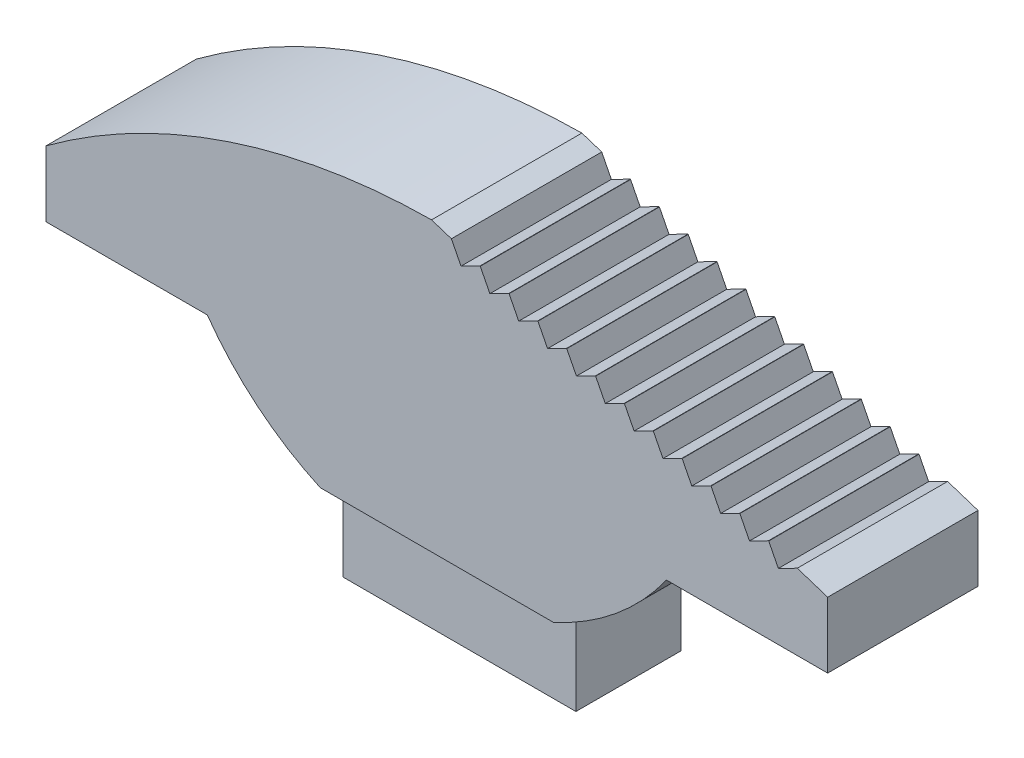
ISO-10303-21;
HEADER;
FILE_DESCRIPTION(('STEP AP214'),'2;1');
FILE_NAME('part.step','',(''),(''),'','','');
FILE_SCHEMA(('AUTOMOTIVE_DESIGN { 1 0 10303 214 1 1 1 1 }'));
ENDSEC;
DATA;
#1=APPLICATION_CONTEXT('core data for automotive mechanical design processes');
#2=APPLICATION_PROTOCOL_DEFINITION('international standard','automotive_design',2000,#1);
#3=PRODUCT_CONTEXT('',#1,'mechanical');
#4=PRODUCT('Part','Part','',(#3));
#5=PRODUCT_RELATED_PRODUCT_CATEGORY('part','',(#4));
#6=PRODUCT_DEFINITION_FORMATION('','',#4);
#7=PRODUCT_DEFINITION_CONTEXT('part definition',#1,'design');
#8=PRODUCT_DEFINITION('design','',#6,#7);
#9=PRODUCT_DEFINITION_SHAPE('','',#8);
#10=(LENGTH_UNIT() NAMED_UNIT(*) SI_UNIT(.MILLI.,.METRE.));
#11=(NAMED_UNIT(*) PLANE_ANGLE_UNIT() SI_UNIT($,.RADIAN.));
#12=(NAMED_UNIT(*) SI_UNIT($,.STERADIAN.) SOLID_ANGLE_UNIT());
#13=UNCERTAINTY_MEASURE_WITH_UNIT(LENGTH_MEASURE(1.E-05),#10,'distance_accuracy_value','');
#14=(GEOMETRIC_REPRESENTATION_CONTEXT(3) GLOBAL_UNCERTAINTY_ASSIGNED_CONTEXT((#13)) GLOBAL_UNIT_ASSIGNED_CONTEXT((#10,
#11,#12)) REPRESENTATION_CONTEXT('',''));
#15=CARTESIAN_POINT('',(0.,0.,0.));
#16=DIRECTION('',(0.,0.,1.));
#17=DIRECTION('',(1.,0.,0.));
#18=AXIS2_PLACEMENT_3D('',#15,#16,#17);
#19=CARTESIAN_POINT('',(8.9552074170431,1.41237823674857,-0.7112));
#20=DIRECTION('',(0.309016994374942,0.951056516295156,0.));
#21=DIRECTION('',(-0.951056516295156,0.309016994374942,0.));
#22=AXIS2_PLACEMENT_3D('',#19,#20,#21);
#23=PLANE('',#22);
#24=DIRECTION('',(0.,0.,1.));
#25=VECTOR('',#24,1.);
#26=CARTESIAN_POINT('',(5.86587869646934,2.41616198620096,-0.7112));
#27=LINE('',#26,#25);
#28=CARTESIAN_POINT('',(5.86587869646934,2.41616198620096,-1.016));
#29=VERTEX_POINT('',#28);
#30=CARTESIAN_POINT('',(5.86587869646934,2.41616198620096,1.016));
#31=VERTEX_POINT('',#30);
#32=EDGE_CURVE('E413',#29,#31,#27,.T.);
#33=ORIENTED_EDGE('',*,*,#32,.T.);
#34=DIRECTION('',(-0.951056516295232,0.309016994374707,0.));
#35=VECTOR('',#34,1.);
#36=CARTESIAN_POINT('',(5.86968292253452,2.41492591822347,1.016));
#37=LINE('',#36,#35);
#38=CARTESIAN_POINT('',(5.86968292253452,2.41492591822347,1.016));
#39=VERTEX_POINT('',#38);
#40=EDGE_CURVE('E874',#39,#31,#37,.T.);
#41=ORIENTED_EDGE('',*,*,#40,.F.);
#42=DIRECTION('',(0.,0.,1.));
#43=VECTOR('',#42,1.);
#44=CARTESIAN_POINT('',(5.86968292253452,2.41492591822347,-0.7112));
#45=LINE('',#44,#43);
#46=CARTESIAN_POINT('',(5.86968292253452,2.41492591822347,-1.016));
#47=VERTEX_POINT('',#46);
#48=EDGE_CURVE('E415',#47,#39,#45,.T.);
#49=ORIENTED_EDGE('',*,*,#48,.F.);
#50=DIRECTION('',(-0.951056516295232,0.309016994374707,0.));
#51=VECTOR('',#50,1.);
#52=CARTESIAN_POINT('',(5.86968292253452,2.41492591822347,-1.016));
#53=LINE('',#52,#51);
#54=EDGE_CURVE('E595',#47,#29,#53,.T.);
#55=ORIENTED_EDGE('',*,*,#54,.T.);
#56=EDGE_LOOP('',(#33,#41,#49,#55));
#57=FACE_BOUND('',#56,.T.);
#58=ADVANCED_FACE('F31',(#57),#23,.T.);
#59=DIRECTION('',(0.,0.,1.));
#60=VECTOR('',#59,1.);
#61=CARTESIAN_POINT('',(6.25581186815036,2.28946501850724,-0.7112));
#62=LINE('',#61,#60);
#63=CARTESIAN_POINT('',(6.25581186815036,2.28946501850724,-1.016));
#64=VERTEX_POINT('',#63);
#65=CARTESIAN_POINT('',(6.25581186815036,2.28946501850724,1.016));
#66=VERTEX_POINT('',#65);
#67=EDGE_CURVE('E419',#64,#66,#62,.T.);
#68=ORIENTED_EDGE('',*,*,#67,.T.);
#69=DIRECTION('',(-0.951056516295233,0.309016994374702,0.));
#70=VECTOR('',#69,1.);
#71=CARTESIAN_POINT('',(6.25961609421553,2.28822895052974,1.016));
#72=LINE('',#71,#70);
#73=CARTESIAN_POINT('',(6.25961609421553,2.28822895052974,1.016));
#74=VERTEX_POINT('',#73);
#75=EDGE_CURVE('E586',#74,#66,#72,.T.);
#76=ORIENTED_EDGE('',*,*,#75,.F.);
#77=DIRECTION('',(0.,0.,1.));
#78=VECTOR('',#77,1.);
#79=CARTESIAN_POINT('',(6.25961609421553,2.28822895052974,-0.7112));
#80=LINE('',#79,#78);
#81=CARTESIAN_POINT('',(6.25961609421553,2.28822895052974,-1.016));
#82=VERTEX_POINT('',#81);
#83=EDGE_CURVE('E421',#82,#74,#80,.T.);
#84=ORIENTED_EDGE('',*,*,#83,.F.);
#85=DIRECTION('',(-0.951056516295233,0.309016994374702,0.));
#86=VECTOR('',#85,1.);
#87=CARTESIAN_POINT('',(6.25961609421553,2.28822895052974,-1.016));
#88=LINE('',#87,#86);
#89=EDGE_CURVE('E715',#82,#64,#88,.T.);
#90=ORIENTED_EDGE('',*,*,#89,.T.);
#91=EDGE_LOOP('',(#68,#76,#84,#90));
#92=FACE_BOUND('',#91,.T.);
#93=ADVANCED_FACE('F868',(#92),#23,.T.);
#94=DIRECTION('',(0.,0.,1.));
#95=VECTOR('',#94,1.);
#96=CARTESIAN_POINT('',(6.64574503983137,2.16276805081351,-0.7112));
#97=LINE('',#96,#95);
#98=CARTESIAN_POINT('',(6.64574503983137,2.16276805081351,-1.016));
#99=VERTEX_POINT('',#98);
#100=CARTESIAN_POINT('',(6.64574503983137,2.16276805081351,1.016));
#101=VERTEX_POINT('',#100);
#102=EDGE_CURVE('E425',#99,#101,#97,.T.);
#103=ORIENTED_EDGE('',*,*,#102,.T.);
#104=DIRECTION('',(-0.951056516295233,0.309016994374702,0.));
#105=VECTOR('',#104,1.);
#106=CARTESIAN_POINT('',(6.64954926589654,2.16153198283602,1.016));
#107=LINE('',#106,#105);
#108=CARTESIAN_POINT('',(6.64954926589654,2.16153198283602,1.016));
#109=VERTEX_POINT('',#108);
#110=EDGE_CURVE('E577',#109,#101,#107,.T.);
#111=ORIENTED_EDGE('',*,*,#110,.F.);
#112=DIRECTION('',(0.,0.,1.));
#113=VECTOR('',#112,1.);
#114=CARTESIAN_POINT('',(6.64954926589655,2.16153198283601,-0.7112));
#115=LINE('',#114,#113);
#116=CARTESIAN_POINT('',(6.64954926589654,2.16153198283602,-1.016));
#117=VERTEX_POINT('',#116);
#118=EDGE_CURVE('E427',#117,#109,#115,.T.);
#119=ORIENTED_EDGE('',*,*,#118,.F.);
#120=DIRECTION('',(-0.951056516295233,0.309016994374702,0.));
#121=VECTOR('',#120,1.);
#122=CARTESIAN_POINT('',(6.64954926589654,2.16153198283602,-1.016));
#123=LINE('',#122,#121);
#124=EDGE_CURVE('E706',#117,#99,#123,.T.);
#125=ORIENTED_EDGE('',*,*,#124,.T.);
#126=EDGE_LOOP('',(#103,#111,#119,#125));
#127=FACE_BOUND('',#126,.T.);
#128=ADVANCED_FACE('F856',(#127),#23,.T.);
#129=DIRECTION('',(0.,0.,1.));
#130=VECTOR('',#129,1.);
#131=CARTESIAN_POINT('',(7.03567821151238,2.03607108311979,-0.7112));
#132=LINE('',#131,#130);
#133=CARTESIAN_POINT('',(7.03567821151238,2.03607108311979,-1.016));
#134=VERTEX_POINT('',#133);
#135=CARTESIAN_POINT('',(7.03567821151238,2.03607108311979,1.016));
#136=VERTEX_POINT('',#135);
#137=EDGE_CURVE('E431',#134,#136,#132,.T.);
#138=ORIENTED_EDGE('',*,*,#137,.T.);
#139=DIRECTION('',(-0.951056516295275,0.309016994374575,0.));
#140=VECTOR('',#139,1.);
#141=CARTESIAN_POINT('',(7.03948243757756,2.03483501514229,1.016));
#142=LINE('',#141,#140);
#143=CARTESIAN_POINT('',(7.03948243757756,2.03483501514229,1.016));
#144=VERTEX_POINT('',#143);
#145=EDGE_CURVE('E568',#144,#136,#142,.T.);
#146=ORIENTED_EDGE('',*,*,#145,.F.);
#147=DIRECTION('',(0.,0.,1.));
#148=VECTOR('',#147,1.);
#149=CARTESIAN_POINT('',(7.03948243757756,2.03483501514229,-0.7112));
#150=LINE('',#149,#148);
#151=CARTESIAN_POINT('',(7.03948243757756,2.03483501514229,-1.016));
#152=VERTEX_POINT('',#151);
#153=EDGE_CURVE('E433',#152,#144,#150,.T.);
#154=ORIENTED_EDGE('',*,*,#153,.F.);
#155=DIRECTION('',(-0.951056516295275,0.309016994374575,0.));
#156=VECTOR('',#155,1.);
#157=CARTESIAN_POINT('',(7.03948243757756,2.03483501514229,-1.016));
#158=LINE('',#157,#156);
#159=EDGE_CURVE('E697',#152,#134,#158,.T.);
#160=ORIENTED_EDGE('',*,*,#159,.T.);
#161=EDGE_LOOP('',(#138,#146,#154,#160));
#162=FACE_BOUND('',#161,.T.);
#163=ADVANCED_FACE('F844',(#162),#23,.T.);
#164=DIRECTION('',(0.,0.,1.));
#165=VECTOR('',#164,1.);
#166=CARTESIAN_POINT('',(7.4256113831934,1.90937411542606,-0.7112));
#167=LINE('',#166,#165);
#168=CARTESIAN_POINT('',(7.4256113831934,1.90937411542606,-1.016));
#169=VERTEX_POINT('',#168);
#170=CARTESIAN_POINT('',(7.4256113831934,1.90937411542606,1.016));
#171=VERTEX_POINT('',#170);
#172=EDGE_CURVE('E437',#169,#171,#167,.T.);
#173=ORIENTED_EDGE('',*,*,#172,.T.);
#174=DIRECTION('',(-0.951056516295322,0.309016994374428,0.));
#175=VECTOR('',#174,1.);
#176=CARTESIAN_POINT('',(7.42941560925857,1.90813804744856,1.016));
#177=LINE('',#176,#175);
#178=CARTESIAN_POINT('',(7.42941560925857,1.90813804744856,1.016));
#179=VERTEX_POINT('',#178);
#180=EDGE_CURVE('E559',#179,#171,#177,.T.);
#181=ORIENTED_EDGE('',*,*,#180,.F.);
#182=DIRECTION('',(0.,0.,1.));
#183=VECTOR('',#182,1.);
#184=CARTESIAN_POINT('',(7.42941560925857,1.90813804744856,-0.7112));
#185=LINE('',#184,#183);
#186=CARTESIAN_POINT('',(7.42941560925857,1.90813804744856,-1.016));
#187=VERTEX_POINT('',#186);
#188=EDGE_CURVE('E439',#187,#179,#185,.T.);
#189=ORIENTED_EDGE('',*,*,#188,.F.);
#190=DIRECTION('',(-0.951056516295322,0.309016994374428,0.));
#191=VECTOR('',#190,1.);
#192=CARTESIAN_POINT('',(7.42941560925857,1.90813804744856,-1.016));
#193=LINE('',#192,#191);
#194=EDGE_CURVE('E688',#187,#169,#193,.T.);
#195=ORIENTED_EDGE('',*,*,#194,.T.);
#196=EDGE_LOOP('',(#173,#181,#189,#195));
#197=FACE_BOUND('',#196,.T.);
#198=ADVANCED_FACE('F832',(#197),#23,.T.);
#199=DIRECTION('',(0.,0.,1.));
#200=VECTOR('',#199,1.);
#201=CARTESIAN_POINT('',(7.81554455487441,1.78267714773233,-0.7112));
#202=LINE('',#201,#200);
#203=CARTESIAN_POINT('',(7.81554455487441,1.78267714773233,-1.016));
#204=VERTEX_POINT('',#203);
#205=CARTESIAN_POINT('',(7.81554455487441,1.78267714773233,1.016));
#206=VERTEX_POINT('',#205);
#207=EDGE_CURVE('E443',#204,#206,#202,.T.);
#208=ORIENTED_EDGE('',*,*,#207,.T.);
#209=DIRECTION('',(-0.951056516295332,0.309016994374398,0.));
#210=VECTOR('',#209,1.);
#211=CARTESIAN_POINT('',(7.81934878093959,1.78144107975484,1.016));
#212=LINE('',#211,#210);
#213=CARTESIAN_POINT('',(7.81934878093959,1.78144107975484,1.016));
#214=VERTEX_POINT('',#213);
#215=EDGE_CURVE('E550',#214,#206,#212,.T.);
#216=ORIENTED_EDGE('',*,*,#215,.F.);
#217=DIRECTION('',(0.,0.,1.));
#218=VECTOR('',#217,1.);
#219=CARTESIAN_POINT('',(7.81934878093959,1.78144107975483,-0.7112));
#220=LINE('',#219,#218);
#221=CARTESIAN_POINT('',(7.81934878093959,1.78144107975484,-1.016));
#222=VERTEX_POINT('',#221);
#223=EDGE_CURVE('E445',#222,#214,#220,.T.);
#224=ORIENTED_EDGE('',*,*,#223,.F.);
#225=DIRECTION('',(-0.951056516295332,0.309016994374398,0.));
#226=VECTOR('',#225,1.);
#227=CARTESIAN_POINT('',(7.81934878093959,1.78144107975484,-1.016));
#228=LINE('',#227,#226);
#229=EDGE_CURVE('E679',#222,#204,#228,.T.);
#230=ORIENTED_EDGE('',*,*,#229,.T.);
#231=EDGE_LOOP('',(#208,#216,#224,#230));
#232=FACE_BOUND('',#231,.T.);
#233=ADVANCED_FACE('F820',(#232),#23,.T.);
#234=DIRECTION('',(0.,0.,1.));
#235=VECTOR('',#234,1.);
#236=CARTESIAN_POINT('',(8.20547772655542,1.65598018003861,-0.7112));
#237=LINE('',#236,#235);
#238=CARTESIAN_POINT('',(8.20547772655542,1.65598018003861,-1.016));
#239=VERTEX_POINT('',#238);
#240=CARTESIAN_POINT('',(8.20547772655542,1.65598018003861,1.016));
#241=VERTEX_POINT('',#240);
#242=EDGE_CURVE('E449',#239,#241,#237,.T.);
#243=ORIENTED_EDGE('',*,*,#242,.T.);
#244=DIRECTION('',(-0.951056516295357,0.30901699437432,0.));
#245=VECTOR('',#244,1.);
#246=CARTESIAN_POINT('',(8.2092819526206,1.65474411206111,1.016));
#247=LINE('',#246,#245);
#248=CARTESIAN_POINT('',(8.2092819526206,1.65474411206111,1.016));
#249=VERTEX_POINT('',#248);
#250=EDGE_CURVE('E541',#249,#241,#247,.T.);
#251=ORIENTED_EDGE('',*,*,#250,.F.);
#252=DIRECTION('',(0.,0.,1.));
#253=VECTOR('',#252,1.);
#254=CARTESIAN_POINT('',(8.2092819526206,1.65474411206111,-0.7112));
#255=LINE('',#254,#253);
#256=CARTESIAN_POINT('',(8.2092819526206,1.65474411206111,-1.016));
#257=VERTEX_POINT('',#256);
#258=EDGE_CURVE('E451',#257,#249,#255,.T.);
#259=ORIENTED_EDGE('',*,*,#258,.F.);
#260=DIRECTION('',(-0.951056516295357,0.30901699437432,0.));
#261=VECTOR('',#260,1.);
#262=CARTESIAN_POINT('',(8.2092819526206,1.65474411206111,-1.016));
#263=LINE('',#262,#261);
#264=EDGE_CURVE('E670',#257,#239,#263,.T.);
#265=ORIENTED_EDGE('',*,*,#264,.T.);
#266=EDGE_LOOP('',(#243,#251,#259,#265));
#267=FACE_BOUND('',#266,.T.);
#268=ADVANCED_FACE('F808',(#267),#23,.T.);
#269=DIRECTION('',(0.,0.,1.));
#270=VECTOR('',#269,1.);
#271=CARTESIAN_POINT('',(8.59541089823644,1.52928321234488,-0.7112));
#272=LINE('',#271,#270);
#273=CARTESIAN_POINT('',(8.59541089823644,1.52928321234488,-1.016));
#274=VERTEX_POINT('',#273);
#275=CARTESIAN_POINT('',(8.59541089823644,1.52928321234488,1.016));
#276=VERTEX_POINT('',#275);
#277=EDGE_CURVE('E455',#274,#276,#272,.T.);
#278=ORIENTED_EDGE('',*,*,#277,.T.);
#279=DIRECTION('',(-0.951056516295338,0.309016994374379,0.));
#280=VECTOR('',#279,1.);
#281=CARTESIAN_POINT('',(8.59921512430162,1.52804714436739,1.016));
#282=LINE('',#281,#280);
#283=CARTESIAN_POINT('',(8.59921512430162,1.52804714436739,1.016));
#284=VERTEX_POINT('',#283);
#285=EDGE_CURVE('E532',#284,#276,#282,.T.);
#286=ORIENTED_EDGE('',*,*,#285,.F.);
#287=DIRECTION('',(0.,0.,1.));
#288=VECTOR('',#287,1.);
#289=CARTESIAN_POINT('',(8.59921512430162,1.52804714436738,-0.7112));
#290=LINE('',#289,#288);
#291=CARTESIAN_POINT('',(8.59921512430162,1.52804714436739,-1.016));
#292=VERTEX_POINT('',#291);
#293=EDGE_CURVE('E457',#292,#284,#290,.T.);
#294=ORIENTED_EDGE('',*,*,#293,.F.);
#295=DIRECTION('',(-0.951056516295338,0.309016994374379,0.));
#296=VECTOR('',#295,1.);
#297=CARTESIAN_POINT('',(8.59921512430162,1.52804714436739,-1.016));
#298=LINE('',#297,#296);
#299=EDGE_CURVE('E661',#292,#274,#298,.T.);
#300=ORIENTED_EDGE('',*,*,#299,.T.);
#301=EDGE_LOOP('',(#278,#286,#294,#300));
#302=FACE_BOUND('',#301,.T.);
#303=ADVANCED_FACE('F796',(#302),#23,.T.);
#304=DIRECTION('',(0.,0.,1.));
#305=VECTOR('',#304,1.);
#306=CARTESIAN_POINT('',(8.98534406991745,1.40258624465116,-0.7112));
#307=LINE('',#306,#305);
#308=CARTESIAN_POINT('',(8.98534406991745,1.40258624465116,-1.016));
#309=VERTEX_POINT('',#308);
#310=CARTESIAN_POINT('',(8.98534406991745,1.40258624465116,1.016));
#311=VERTEX_POINT('',#310);
#312=EDGE_CURVE('E461',#309,#311,#307,.T.);
#313=ORIENTED_EDGE('',*,*,#312,.T.);
#314=DIRECTION('',(-0.951056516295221,0.309016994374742,0.));
#315=VECTOR('',#314,1.);
#316=CARTESIAN_POINT('',(8.98914829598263,1.40135017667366,1.016));
#317=LINE('',#316,#315);
#318=CARTESIAN_POINT('',(8.98914829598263,1.40135017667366,1.016));
#319=VERTEX_POINT('',#318);
#320=EDGE_CURVE('E523',#319,#311,#317,.T.);
#321=ORIENTED_EDGE('',*,*,#320,.F.);
#322=DIRECTION('',(0.,0.,1.));
#323=VECTOR('',#322,1.);
#324=CARTESIAN_POINT('',(8.98914829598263,1.40135017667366,-0.7112));
#325=LINE('',#324,#323);
#326=CARTESIAN_POINT('',(8.98914829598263,1.40135017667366,-1.016));
#327=VERTEX_POINT('',#326);
#328=EDGE_CURVE('E463',#327,#319,#325,.T.);
#329=ORIENTED_EDGE('',*,*,#328,.F.);
#330=DIRECTION('',(-0.951056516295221,0.309016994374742,0.));
#331=VECTOR('',#330,1.);
#332=CARTESIAN_POINT('',(8.98914829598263,1.40135017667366,-1.016));
#333=LINE('',#332,#331);
#334=EDGE_CURVE('E652',#327,#309,#333,.T.);
#335=ORIENTED_EDGE('',*,*,#334,.T.);
#336=EDGE_LOOP('',(#313,#321,#329,#335));
#337=FACE_BOUND('',#336,.T.);
#338=ADVANCED_FACE('F784',(#337),#23,.T.);
#339=DIRECTION('',(0.,0.,1.));
#340=VECTOR('',#339,1.);
#341=CARTESIAN_POINT('',(9.37527724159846,1.27588927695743,-0.7112));
#342=LINE('',#341,#340);
#343=CARTESIAN_POINT('',(9.37527724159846,1.27588927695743,-1.016));
#344=VERTEX_POINT('',#343);
#345=CARTESIAN_POINT('',(9.37527724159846,1.27588927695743,1.016));
#346=VERTEX_POINT('',#345);
#347=EDGE_CURVE('E467',#344,#346,#342,.T.);
#348=ORIENTED_EDGE('',*,*,#347,.T.);
#349=DIRECTION('',(-0.9510565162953,0.309016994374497,0.));
#350=VECTOR('',#349,1.);
#351=CARTESIAN_POINT('',(9.37908146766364,1.27465320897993,1.016));
#352=LINE('',#351,#350);
#353=CARTESIAN_POINT('',(9.37908146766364,1.27465320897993,1.016));
#354=VERTEX_POINT('',#353);
#355=EDGE_CURVE('E514',#354,#346,#352,.T.);
#356=ORIENTED_EDGE('',*,*,#355,.F.);
#357=DIRECTION('',(0.,0.,1.));
#358=VECTOR('',#357,1.);
#359=CARTESIAN_POINT('',(9.37908146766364,1.27465320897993,-0.7112));
#360=LINE('',#359,#358);
#361=CARTESIAN_POINT('',(9.37908146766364,1.27465320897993,-1.016));
#362=VERTEX_POINT('',#361);
#363=EDGE_CURVE('E469',#362,#354,#360,.T.);
#364=ORIENTED_EDGE('',*,*,#363,.F.);
#365=DIRECTION('',(-0.9510565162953,0.309016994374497,0.));
#366=VECTOR('',#365,1.);
#367=CARTESIAN_POINT('',(9.37908146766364,1.27465320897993,-1.016));
#368=LINE('',#367,#366);
#369=EDGE_CURVE('E643',#362,#344,#368,.T.);
#370=ORIENTED_EDGE('',*,*,#369,.T.);
#371=EDGE_LOOP('',(#348,#356,#364,#370));
#372=FACE_BOUND('',#371,.T.);
#373=ADVANCED_FACE('F772',(#372),#23,.T.);
#374=DIRECTION('',(0.,0.,1.));
#375=VECTOR('',#374,1.);
#376=CARTESIAN_POINT('',(9.76521041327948,1.1491923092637,-0.7112));
#377=LINE('',#376,#375);
#378=CARTESIAN_POINT('',(9.76521041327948,1.1491923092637,-1.016));
#379=VERTEX_POINT('',#378);
#380=CARTESIAN_POINT('',(9.76521041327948,1.1491923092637,1.016));
#381=VERTEX_POINT('',#380);
#382=EDGE_CURVE('E473',#379,#381,#377,.T.);
#383=ORIENTED_EDGE('',*,*,#382,.T.);
#384=DIRECTION('',(-0.951056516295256,0.309016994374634,0.));
#385=VECTOR('',#384,1.);
#386=CARTESIAN_POINT('',(9.76901463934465,1.14795624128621,1.016));
#387=LINE('',#386,#385);
#388=CARTESIAN_POINT('',(9.76901463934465,1.14795624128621,1.016));
#389=VERTEX_POINT('',#388);
#390=EDGE_CURVE('E499',#389,#381,#387,.T.);
#391=ORIENTED_EDGE('',*,*,#390,.F.);
#392=DIRECTION('',(0.,0.,1.));
#393=VECTOR('',#392,1.);
#394=CARTESIAN_POINT('',(9.76901463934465,1.1479562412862,-0.7112));
#395=LINE('',#394,#393);
#396=CARTESIAN_POINT('',(9.76901463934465,1.14795624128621,-1.016));
#397=VERTEX_POINT('',#396);
#398=EDGE_CURVE('E475',#397,#389,#395,.T.);
#399=ORIENTED_EDGE('',*,*,#398,.F.);
#400=DIRECTION('',(-0.951056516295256,0.309016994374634,0.));
#401=VECTOR('',#400,1.);
#402=CARTESIAN_POINT('',(9.76901463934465,1.14795624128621,-1.016));
#403=LINE('',#402,#401);
#404=EDGE_CURVE('E635',#397,#379,#403,.T.);
#405=ORIENTED_EDGE('',*,*,#404,.T.);
#406=EDGE_LOOP('',(#383,#391,#399,#405));
#407=FACE_BOUND('',#406,.T.);
#408=ADVANCED_FACE('F505',(#407),#23,.T.);
#409=DIRECTION('',(0.,0.,1.));
#410=VECTOR('',#409,1.);
#411=CARTESIAN_POINT('',(10.1551435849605,1.02249534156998,-0.7112));
#412=LINE('',#411,#410);
#413=CARTESIAN_POINT('',(10.1551435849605,1.02249534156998,-1.016));
#414=VERTEX_POINT('',#413);
#415=CARTESIAN_POINT('',(10.1551435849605,1.02249534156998,1.016));
#416=VERTEX_POINT('',#415);
#417=EDGE_CURVE('E362',#414,#416,#412,.T.);
#418=ORIENTED_EDGE('',*,*,#417,.T.);
#419=DIRECTION('',(-0.951056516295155,0.309016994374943,0.));
#420=VECTOR('',#419,1.);
#421=CARTESIAN_POINT('',(10.566,0.889000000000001,1.016));
#422=LINE('',#421,#420);
#423=CARTESIAN_POINT('',(10.566,0.889000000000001,1.016));
#424=VERTEX_POINT('',#423);
#425=EDGE_CURVE('E751',#424,#416,#422,.T.);
#426=ORIENTED_EDGE('',*,*,#425,.F.);
#427=DIRECTION('',(0.,0.,1.));
#428=VECTOR('',#427,1.);
#429=CARTESIAN_POINT('',(10.566,0.889000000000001,-0.7112));
#430=LINE('',#429,#428);
#431=CARTESIAN_POINT('',(10.566,0.889000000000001,-1.016));
#432=VERTEX_POINT('',#431);
#433=EDGE_CURVE('E377',#432,#424,#430,.T.);
#434=ORIENTED_EDGE('',*,*,#433,.F.);
#435=DIRECTION('',(-0.951056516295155,0.309016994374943,0.));
#436=VECTOR('',#435,1.);
#437=CARTESIAN_POINT('',(10.566,0.889000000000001,-1.016));
#438=LINE('',#437,#436);
#439=EDGE_CURVE('E628',#432,#414,#438,.T.);
#440=ORIENTED_EDGE('',*,*,#439,.T.);
#441=EDGE_LOOP('',(#418,#426,#434,#440));
#442=FACE_BOUND('',#441,.T.);
#443=ADVANCED_FACE('F902',(#442),#23,.T.);
#444=CARTESIAN_POINT('',(3.708,-9.44362836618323,-0.7112));
#445=DIRECTION('',(1.,0.,0.));
#446=DIRECTION('',(0.,1.,0.));
#447=AXIS2_PLACEMENT_3D('',#444,#445,#446);
#448=PLANE('',#447);
#449=DIRECTION('',(0.,1.,0.));
#450=VECTOR('',#449,1.);
#451=CARTESIAN_POINT('',(3.708,-9.44362836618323,-0.7112));
#452=LINE('',#451,#450);
#453=CARTESIAN_POINT('',(3.708,-2.45612175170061,-0.7112));
#454=VERTEX_POINT('',#453);
#455=CARTESIAN_POINT('',(3.708,-1.2589701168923,-0.7112));
#456=VERTEX_POINT('',#455);
#457=EDGE_CURVE('E54',#454,#456,#452,.T.);
#458=ORIENTED_EDGE('',*,*,#457,.F.);
#459=DIRECTION('',(0.,0.,1.));
#460=VECTOR('',#459,1.);
#461=CARTESIAN_POINT('',(3.708,-2.45612175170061,-1.016));
#462=LINE('',#461,#460);
#463=CARTESIAN_POINT('',(3.708,-2.45612175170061,0.7112));
#464=VERTEX_POINT('',#463);
#465=EDGE_CURVE('E344',#454,#464,#462,.T.);
#466=ORIENTED_EDGE('',*,*,#465,.T.);
#467=DIRECTION('',(0.,1.,0.));
#468=VECTOR('',#467,1.);
#469=CARTESIAN_POINT('',(3.708,-9.44362836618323,0.7112));
#470=LINE('',#469,#468);
#471=CARTESIAN_POINT('',(3.708,-1.2589701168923,0.7112));
#472=VERTEX_POINT('',#471);
#473=EDGE_CURVE('E351',#464,#472,#470,.T.);
#474=ORIENTED_EDGE('',*,*,#473,.T.);
#475=DIRECTION('',(0.,0.,1.));
#476=VECTOR('',#475,1.);
#477=CARTESIAN_POINT('',(3.708,-1.2589701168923,-0.7112));
#478=LINE('',#477,#476);
#479=EDGE_CURVE('E39',#456,#472,#478,.T.);
#480=ORIENTED_EDGE('',*,*,#479,.F.);
#481=EDGE_LOOP('',(#458,#466,#474,#480));
#482=FACE_BOUND('',#481,.T.);
#483=ADVANCED_FACE('F350',(#482),#448,.F.);
#484=CARTESIAN_POINT('',(5.28354635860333,2.21,-0.7112));
#485=DIRECTION('',(0.,0.,1.));
#486=DIRECTION('',(1.,0.,0.));
#487=AXIS2_PLACEMENT_3D('',#484,#485,#486);
#488=CYLINDRICAL_SURFACE('',#487,3.81);
#489=ORIENTED_EDGE('',*,*,#479,.T.);
#490=DIRECTION('',(0.,0.,1.));
#491=VECTOR('',#490,1.);
#492=CARTESIAN_POINT('',(3.708,-1.2589701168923,-1.016));
#493=LINE('',#492,#491);
#494=CARTESIAN_POINT('',(3.708,-1.2589701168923,1.016));
#495=VERTEX_POINT('',#494);
#496=EDGE_CURVE('E411',#472,#495,#493,.T.);
#497=ORIENTED_EDGE('',*,*,#496,.T.);
#498=CARTESIAN_POINT('',(5.28354635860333,2.21,1.016));
#499=DIRECTION('',(0.,0.,1.));
#500=DIRECTION('',(1.,0.,0.));
#501=AXIS2_PLACEMENT_3D('',#498,#499,#500);
#502=CIRCLE('',#501,3.81);
#503=CARTESIAN_POINT('',(2.18,0.,1.016));
#504=VERTEX_POINT('',#503);
#505=EDGE_CURVE('E728',#504,#495,#502,.T.);
#506=ORIENTED_EDGE('',*,*,#505,.F.);
#507=DIRECTION('',(0.,0.,1.));
#508=VECTOR('',#507,1.);
#509=CARTESIAN_POINT('',(2.18,0.,-0.7112));
#510=LINE('',#509,#508);
#511=CARTESIAN_POINT('',(2.18,0.,-1.016));
#512=VERTEX_POINT('',#511);
#513=EDGE_CURVE('E369',#512,#504,#510,.T.);
#514=ORIENTED_EDGE('',*,*,#513,.F.);
#515=CARTESIAN_POINT('',(5.28354635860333,2.21,-1.016));
#516=DIRECTION('',(0.,0.,1.));
#517=DIRECTION('',(1.,0.,0.));
#518=AXIS2_PLACEMENT_3D('',#515,#516,#517);
#519=CIRCLE('',#518,3.81);
#520=CARTESIAN_POINT('',(3.708,-1.2589701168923,-1.016));
#521=VERTEX_POINT('',#520);
#522=EDGE_CURVE('E616',#512,#521,#519,.T.);
#523=ORIENTED_EDGE('',*,*,#522,.T.);
#524=EDGE_CURVE('E406',#521,#456,#493,.T.);
#525=ORIENTED_EDGE('',*,*,#524,.T.);
#526=EDGE_LOOP('',(#489,#497,#506,#514,#523,#525));
#527=FACE_BOUND('',#526,.T.);
#528=ADVANCED_FACE('F727',(#527),#488,.T.);
#529=CARTESIAN_POINT('',(5.42787704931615,0.,-0.7112));
#530=DIRECTION('',(0.,-1.,0.));
#531=DIRECTION('',(0.,0.,-1.));
#532=AXIS2_PLACEMENT_3D('',#529,#530,#531);
#533=PLANE('',#532);
#534=ORIENTED_EDGE('',*,*,#513,.T.);
#535=DIRECTION('',(1.,0.,0.));
#536=VECTOR('',#535,1.);
#537=CARTESIAN_POINT('',(0.,0.,1.016));
#538=LINE('',#537,#536);
#539=CARTESIAN_POINT('',(0.,0.,1.016));
#540=VERTEX_POINT('',#539);
#541=EDGE_CURVE('E737',#540,#504,#538,.T.);
#542=ORIENTED_EDGE('',*,*,#541,.F.);
#543=DIRECTION('',(0.,0.,1.));
#544=VECTOR('',#543,1.);
#545=CARTESIAN_POINT('',(0.,0.,-0.7112));
#546=LINE('',#545,#544);
#547=CARTESIAN_POINT('',(0.,0.,-1.016));
#548=VERTEX_POINT('',#547);
#549=EDGE_CURVE('E371',#548,#540,#546,.T.);
#550=ORIENTED_EDGE('',*,*,#549,.F.);
#551=DIRECTION('',(1.,0.,0.));
#552=VECTOR('',#551,1.);
#553=CARTESIAN_POINT('',(0.,0.,-1.016));
#554=LINE('',#553,#552);
#555=EDGE_CURVE('E613',#548,#512,#554,.T.);
#556=ORIENTED_EDGE('',*,*,#555,.T.);
#557=EDGE_LOOP('',(#534,#542,#550,#556));
#558=FACE_BOUND('',#557,.T.);
#559=ADVANCED_FACE('F925',(#558),#533,.T.);
#560=CARTESIAN_POINT('',(0.,-9.44362836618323,-0.7112));
#561=DIRECTION('',(1.,0.,0.));
#562=DIRECTION('',(0.,0.,-1.));
#563=AXIS2_PLACEMENT_3D('',#560,#561,#562);
#564=PLANE('',#563);
#565=ORIENTED_EDGE('',*,*,#549,.T.);
#566=DIRECTION('',(0.,-1.,0.));
#567=VECTOR('',#566,1.);
#568=CARTESIAN_POINT('',(0.,0.889,1.016));
#569=LINE('',#568,#567);
#570=CARTESIAN_POINT('',(0.,0.889,1.016));
#571=VERTEX_POINT('',#570);
#572=EDGE_CURVE('E930',#571,#540,#569,.T.);
#573=ORIENTED_EDGE('',*,*,#572,.F.);
#574=DIRECTION('',(0.,0.,1.));
#575=VECTOR('',#574,1.);
#576=CARTESIAN_POINT('',(0.,0.888999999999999,-0.7112));
#577=LINE('',#576,#575);
#578=CARTESIAN_POINT('',(0.,0.889,-1.016));
#579=VERTEX_POINT('',#578);
#580=EDGE_CURVE('E373',#579,#571,#577,.T.);
#581=ORIENTED_EDGE('',*,*,#580,.F.);
#582=DIRECTION('',(0.,-1.,0.));
#583=VECTOR('',#582,1.);
#584=CARTESIAN_POINT('',(0.,0.889,-1.016));
#585=LINE('',#584,#583);
#586=EDGE_CURVE('E610',#579,#548,#585,.T.);
#587=ORIENTED_EDGE('',*,*,#586,.T.);
#588=EDGE_LOOP('',(#565,#573,#581,#587));
#589=FACE_BOUND('',#588,.T.);
#590=ADVANCED_FACE('F909',(#589),#564,.F.);
#591=CARTESIAN_POINT('',(5.283,-6.26096580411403,-0.7112));
#592=DIRECTION('',(0.,0.,1.));
#593=DIRECTION('',(1.,0.,0.));
#594=AXIS2_PLACEMENT_3D('',#591,#592,#593);
#595=CYLINDRICAL_SURFACE('',#594,8.89);
#596=ORIENTED_EDGE('',*,*,#580,.T.);
#597=CARTESIAN_POINT('',(5.283,-6.26096580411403,1.016));
#598=DIRECTION('',(0.,0.,1.));
#599=DIRECTION('',(1.,0.,0.));
#600=AXIS2_PLACEMENT_3D('',#597,#598,#599);
#601=CIRCLE('',#600,8.89);
#602=CARTESIAN_POINT('',(5.21160767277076,2.6287475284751,1.016));
#603=VERTEX_POINT('',#602);
#604=EDGE_CURVE('E933',#603,#571,#601,.T.);
#605=ORIENTED_EDGE('',*,*,#604,.F.);
#606=DIRECTION('',(0.,0.,1.));
#607=VECTOR('',#606,1.);
#608=CARTESIAN_POINT('',(5.21160767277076,2.6287475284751,-0.7112));
#609=LINE('',#608,#607);
#610=CARTESIAN_POINT('',(5.21160767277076,2.6287475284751,-1.016));
#611=VERTEX_POINT('',#610);
#612=EDGE_CURVE('E375',#611,#603,#609,.T.);
#613=ORIENTED_EDGE('',*,*,#612,.F.);
#614=CARTESIAN_POINT('',(5.283,-6.26096580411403,-1.016));
#615=DIRECTION('',(0.,0.,1.));
#616=DIRECTION('',(1.,0.,0.));
#617=AXIS2_PLACEMENT_3D('',#614,#615,#616);
#618=CIRCLE('',#617,8.89);
#619=EDGE_CURVE('E607',#611,#579,#618,.T.);
#620=ORIENTED_EDGE('',*,*,#619,.T.);
#621=EDGE_LOOP('',(#596,#605,#613,#620));
#622=FACE_BOUND('',#621,.T.);
#623=ADVANCED_FACE('F900',(#622),#595,.T.);
#624=DIRECTION('',(0.,0.,1.));
#625=VECTOR('',#624,1.);
#626=CARTESIAN_POINT('',(5.47974975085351,2.54162288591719,-0.7112));
#627=LINE('',#626,#625);
#628=CARTESIAN_POINT('',(5.47974975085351,2.54162288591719,-1.016));
#629=VERTEX_POINT('',#628);
#630=CARTESIAN_POINT('',(5.47974975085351,2.54162288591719,1.016));
#631=VERTEX_POINT('',#630);
#632=EDGE_CURVE('E404',#629,#631,#627,.T.);
#633=ORIENTED_EDGE('',*,*,#632,.F.);
#634=DIRECTION('',(-0.951056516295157,0.309016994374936,0.));
#635=VECTOR('',#634,1.);
#636=CARTESIAN_POINT('',(5.47974975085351,2.54162288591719,-1.016));
#637=LINE('',#636,#635);
#638=EDGE_CURVE('E604',#629,#611,#637,.T.);
#639=ORIENTED_EDGE('',*,*,#638,.T.);
#640=ORIENTED_EDGE('',*,*,#612,.T.);
#641=DIRECTION('',(-0.951056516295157,0.309016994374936,0.));
#642=VECTOR('',#641,1.);
#643=CARTESIAN_POINT('',(5.47974975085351,2.54162288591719,1.016));
#644=LINE('',#643,#642);
#645=EDGE_CURVE('E937',#631,#603,#644,.T.);
#646=ORIENTED_EDGE('',*,*,#645,.F.);
#647=EDGE_LOOP('',(#633,#639,#640,#646));
#648=FACE_BOUND('',#647,.T.);
#649=ADVANCED_FACE('F892',(#648),#23,.T.);
#650=CARTESIAN_POINT('',(10.5660000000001,-9.44362836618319,-0.7112));
#651=DIRECTION('',(1.,0.,0.));
#652=DIRECTION('',(0.,1.,0.));
#653=AXIS2_PLACEMENT_3D('',#650,#651,#652);
#654=PLANE('',#653);
#655=ORIENTED_EDGE('',*,*,#433,.T.);
#656=DIRECTION('',(0.,1.,0.));
#657=VECTOR('',#656,1.);
#658=CARTESIAN_POINT('',(10.566,0.,1.016));
#659=LINE('',#658,#657);
#660=CARTESIAN_POINT('',(10.566,0.,1.016));
#661=VERTEX_POINT('',#660);
#662=EDGE_CURVE('E748',#661,#424,#659,.T.);
#663=ORIENTED_EDGE('',*,*,#662,.F.);
#664=DIRECTION('',(0.,0.,1.));
#665=VECTOR('',#664,1.);
#666=CARTESIAN_POINT('',(10.566,0.,-0.7112));
#667=LINE('',#666,#665);
#668=CARTESIAN_POINT('',(10.566,0.,-1.016));
#669=VERTEX_POINT('',#668);
#670=EDGE_CURVE('E379',#669,#661,#667,.T.);
#671=ORIENTED_EDGE('',*,*,#670,.F.);
#672=DIRECTION('',(0.,1.,0.));
#673=VECTOR('',#672,1.);
#674=CARTESIAN_POINT('',(10.566,0.,-1.016));
#675=LINE('',#674,#673);
#676=EDGE_CURVE('E625',#669,#432,#675,.T.);
#677=ORIENTED_EDGE('',*,*,#676,.T.);
#678=EDGE_LOOP('',(#655,#663,#671,#677));
#679=FACE_BOUND('',#678,.T.);
#680=ADVANCED_FACE('F899',(#679),#654,.T.);
#681=CARTESIAN_POINT('',(5.42787704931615,0.,-0.7112));
#682=DIRECTION('',(0.,-1.,0.));
#683=DIRECTION('',(0.,0.,-1.));
#684=AXIS2_PLACEMENT_3D('',#681,#682,#683);
#685=PLANE('',#684);
#686=ORIENTED_EDGE('',*,*,#670,.T.);
#687=DIRECTION('',(1.,0.,0.));
#688=VECTOR('',#687,1.);
#689=CARTESIAN_POINT('',(8.38709271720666,0.,1.016));
#690=LINE('',#689,#688);
#691=CARTESIAN_POINT('',(8.38709271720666,0.,1.016));
#692=VERTEX_POINT('',#691);
#693=EDGE_CURVE('E742',#692,#661,#690,.T.);
#694=ORIENTED_EDGE('',*,*,#693,.F.);
#695=DIRECTION('',(0.,0.,1.));
#696=VECTOR('',#695,1.);
#697=CARTESIAN_POINT('',(8.38709271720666,0.,-0.7112));
#698=LINE('',#697,#696);
#699=CARTESIAN_POINT('',(8.38709271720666,0.,-1.016));
#700=VERTEX_POINT('',#699);
#701=EDGE_CURVE('E381',#700,#692,#698,.T.);
#702=ORIENTED_EDGE('',*,*,#701,.F.);
#703=DIRECTION('',(1.,0.,0.));
#704=VECTOR('',#703,1.);
#705=CARTESIAN_POINT('',(8.38709271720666,0.,-1.016));
#706=LINE('',#705,#704);
#707=EDGE_CURVE('E622',#700,#669,#706,.T.);
#708=ORIENTED_EDGE('',*,*,#707,.T.);
#709=EDGE_LOOP('',(#686,#694,#702,#708));
#710=FACE_BOUND('',#709,.T.);
#711=ADVANCED_FACE('F907',(#710),#685,.T.);
#712=CARTESIAN_POINT('',(5.28354635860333,2.21,-0.7112));
#713=DIRECTION('',(0.,0.,1.));
#714=DIRECTION('',(1.,0.,0.));
#715=AXIS2_PLACEMENT_3D('',#712,#713,#714);
#716=CYLINDRICAL_SURFACE('',#715,3.81);
#717=ORIENTED_EDGE('',*,*,#701,.T.);
#718=CARTESIAN_POINT('',(5.28354635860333,2.21,1.016));
#719=DIRECTION('',(0.,0.,1.));
#720=DIRECTION('',(1.,0.,0.));
#721=AXIS2_PLACEMENT_3D('',#718,#719,#720);
#722=CIRCLE('',#721,3.81);
#723=CARTESIAN_POINT('',(6.858,-1.25946620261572,1.016));
#724=VERTEX_POINT('',#723);
#725=EDGE_CURVE('E740',#724,#692,#722,.T.);
#726=ORIENTED_EDGE('',*,*,#725,.F.);
#727=DIRECTION('',(0.,0.,1.));
#728=VECTOR('',#727,1.);
#729=CARTESIAN_POINT('',(6.858,-1.25946620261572,-1.016));
#730=LINE('',#729,#728);
#731=CARTESIAN_POINT('',(6.858,-1.25946620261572,0.7112));
#732=VERTEX_POINT('',#731);
#733=EDGE_CURVE('E394',#732,#724,#730,.T.);
#734=ORIENTED_EDGE('',*,*,#733,.F.);
#735=DIRECTION('',(0.,0.,1.));
#736=VECTOR('',#735,1.);
#737=CARTESIAN_POINT('',(6.858,-1.25946620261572,-0.7112));
#738=LINE('',#737,#736);
#739=CARTESIAN_POINT('',(6.858,-1.25946620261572,-0.7112));
#740=VERTEX_POINT('',#739);
#741=EDGE_CURVE('E367',#740,#732,#738,.T.);
#742=ORIENTED_EDGE('',*,*,#741,.F.);
#743=CARTESIAN_POINT('',(6.858,-1.25946620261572,-1.016));
#744=VERTEX_POINT('',#743);
#745=EDGE_CURVE('E391',#744,#740,#730,.T.);
#746=ORIENTED_EDGE('',*,*,#745,.F.);
#747=CARTESIAN_POINT('',(5.28354635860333,2.21,-1.016));
#748=DIRECTION('',(0.,0.,1.));
#749=DIRECTION('',(1.,0.,0.));
#750=AXIS2_PLACEMENT_3D('',#747,#748,#749);
#751=CIRCLE('',#750,3.81);
#752=EDGE_CURVE('E620',#744,#700,#751,.T.);
#753=ORIENTED_EDGE('',*,*,#752,.T.);
#754=EDGE_LOOP('',(#717,#726,#734,#742,#746,#753));
#755=FACE_BOUND('',#754,.T.);
#756=ADVANCED_FACE('F389',(#755),#716,.T.);
#757=CARTESIAN_POINT('',(6.85800000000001,-9.44362836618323,-0.7112));
#758=DIRECTION('',(1.,0.,0.));
#759=DIRECTION('',(0.,1.,0.));
#760=AXIS2_PLACEMENT_3D('',#757,#758,#759);
#761=PLANE('',#760);
#762=DIRECTION('',(0.,0.,1.));
#763=VECTOR('',#762,1.);
#764=CARTESIAN_POINT('',(6.858,-2.45612175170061,-1.016));
#765=LINE('',#764,#763);
#766=CARTESIAN_POINT('',(6.858,-2.45612175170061,-0.7112));
#767=VERTEX_POINT('',#766);
#768=CARTESIAN_POINT('',(6.858,-2.45612175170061,0.7112));
#769=VERTEX_POINT('',#768);
#770=EDGE_CURVE('E46',#767,#769,#765,.T.);
#771=ORIENTED_EDGE('',*,*,#770,.F.);
#772=DIRECTION('',(0.,1.,0.));
#773=VECTOR('',#772,1.);
#774=CARTESIAN_POINT('',(6.85800000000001,-9.44362836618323,-0.7112));
#775=LINE('',#774,#773);
#776=EDGE_CURVE('E358',#767,#740,#775,.T.);
#777=ORIENTED_EDGE('',*,*,#776,.T.);
#778=ORIENTED_EDGE('',*,*,#741,.T.);
#779=DIRECTION('',(0.,1.,0.));
#780=VECTOR('',#779,1.);
#781=CARTESIAN_POINT('',(6.85800000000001,-9.44362836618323,0.7112));
#782=LINE('',#781,#780);
#783=EDGE_CURVE('E359',#769,#732,#782,.T.);
#784=ORIENTED_EDGE('',*,*,#783,.F.);
#785=EDGE_LOOP('',(#771,#777,#778,#784));
#786=FACE_BOUND('',#785,.T.);
#787=ADVANCED_FACE('F33',(#786),#761,.T.);
#788=CARTESIAN_POINT('',(5.42787704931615,-9.44362836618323,-0.7112));
#789=DIRECTION('',(0.,0.,1.));
#790=DIRECTION('',(1.,0.,0.));
#791=AXIS2_PLACEMENT_3D('',#788,#789,#790);
#792=PLANE('',#791);
#793=ORIENTED_EDGE('',*,*,#776,.F.);
#794=DIRECTION('',(-1.,0.,0.));
#795=VECTOR('',#794,1.);
#796=CARTESIAN_POINT('',(5.42787704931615,-2.45612175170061,-0.7112));
#797=LINE('',#796,#795);
#798=EDGE_CURVE('E353',#767,#454,#797,.T.);
#799=ORIENTED_EDGE('',*,*,#798,.T.);
#800=ORIENTED_EDGE('',*,*,#457,.T.);
#801=DIRECTION('',(0.999999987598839,-0.000157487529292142,0.));
#802=VECTOR('',#801,1.);
#803=CARTESIAN_POINT('',(5.429165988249,-1.25924117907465,-0.7112));
#804=LINE('',#803,#802);
#805=EDGE_CURVE('E399',#456,#740,#804,.T.);
#806=ORIENTED_EDGE('',*,*,#805,.T.);
#807=EDGE_LOOP('',(#793,#799,#800,#806));
#808=FACE_BOUND('',#807,.T.);
#809=ADVANCED_FACE('F948',(#808),#792,.F.);
#810=CARTESIAN_POINT('',(5.42787704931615,-9.44362836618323,0.7112));
#811=DIRECTION('',(0.,0.,1.));
#812=DIRECTION('',(1.,0.,0.));
#813=AXIS2_PLACEMENT_3D('',#810,#811,#812);
#814=PLANE('',#813);
#815=DIRECTION('',(-1.,0.,0.));
#816=VECTOR('',#815,1.);
#817=CARTESIAN_POINT('',(3.708,-2.45612175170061,0.7112));
#818=LINE('',#817,#816);
#819=EDGE_CURVE('E341',#769,#464,#818,.T.);
#820=ORIENTED_EDGE('',*,*,#819,.F.);
#821=ORIENTED_EDGE('',*,*,#783,.T.);
#822=DIRECTION('',(0.999999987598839,-0.000157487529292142,0.));
#823=VECTOR('',#822,1.);
#824=CARTESIAN_POINT('',(5.429165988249,-1.25924117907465,0.7112));
#825=LINE('',#824,#823);
#826=EDGE_CURVE('E11',#472,#732,#825,.T.);
#827=ORIENTED_EDGE('',*,*,#826,.F.);
#828=ORIENTED_EDGE('',*,*,#473,.F.);
#829=EDGE_LOOP('',(#820,#821,#827,#828));
#830=FACE_BOUND('',#829,.T.);
#831=ADVANCED_FACE('F356',(#830),#814,.T.);
#832=CARTESIAN_POINT('',(9.89934867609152,0.892161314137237,-0.7112));
#833=DIRECTION('',(0.453990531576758,-0.891006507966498,0.));
#834=DIRECTION('',(0.891006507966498,0.453990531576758,0.));
#835=AXIS2_PLACEMENT_3D('',#832,#833,#834);
#836=PLANE('',#835);
#837=DIRECTION('',(0.,0.,1.));
#838=VECTOR('',#837,1.);
#839=CARTESIAN_POINT('',(9.89934867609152,0.892161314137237,-0.7112));
#840=LINE('',#839,#838);
#841=CARTESIAN_POINT('',(9.89934867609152,0.892161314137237,-1.016));
#842=VERTEX_POINT('',#841);
#843=CARTESIAN_POINT('',(9.89934867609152,0.892161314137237,1.016));
#844=VERTEX_POINT('',#843);
#845=EDGE_CURVE('E480',#842,#844,#840,.T.);
#846=ORIENTED_EDGE('',*,*,#845,.T.);
#847=DIRECTION('',(-0.891006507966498,-0.453990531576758,0.));
#848=VECTOR('',#847,1.);
#849=CARTESIAN_POINT('',(10.1551435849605,1.02249534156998,1.016));
#850=LINE('',#849,#848);
#851=EDGE_CURVE('E503',#416,#844,#850,.T.);
#852=ORIENTED_EDGE('',*,*,#851,.F.);
#853=ORIENTED_EDGE('',*,*,#417,.F.);
#854=DIRECTION('',(-0.891006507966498,-0.453990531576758,0.));
#855=VECTOR('',#854,1.);
#856=CARTESIAN_POINT('',(10.1551435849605,1.02249534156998,-1.016));
#857=LINE('',#856,#855);
#858=EDGE_CURVE('E631',#414,#842,#857,.T.);
#859=ORIENTED_EDGE('',*,*,#858,.T.);
#860=EDGE_LOOP('',(#846,#852,#853,#859));
#861=FACE_BOUND('',#860,.T.);
#862=ADVANCED_FACE('F756',(#861),#836,.F.);
#863=CARTESIAN_POINT('',(9.76901463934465,1.1479562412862,-0.7112));
#864=DIRECTION('',(-0.891006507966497,-0.45399053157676,0.));
#865=DIRECTION('',(0.45399053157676,-0.891006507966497,0.));
#866=AXIS2_PLACEMENT_3D('',#863,#864,#865);
#867=PLANE('',#866);
#868=ORIENTED_EDGE('',*,*,#398,.T.);
#869=DIRECTION('',(-0.453990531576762,0.891006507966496,0.));
#870=VECTOR('',#869,1.);
#871=CARTESIAN_POINT('',(9.89934867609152,0.892161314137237,1.016));
#872=LINE('',#871,#870);
#873=EDGE_CURVE('E486',#844,#389,#872,.T.);
#874=ORIENTED_EDGE('',*,*,#873,.F.);
#875=ORIENTED_EDGE('',*,*,#845,.F.);
#876=DIRECTION('',(-0.453990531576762,0.891006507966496,0.));
#877=VECTOR('',#876,1.);
#878=CARTESIAN_POINT('',(9.89934867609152,0.892161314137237,-1.016));
#879=LINE('',#878,#877);
#880=EDGE_CURVE('E488',#842,#397,#879,.T.);
#881=ORIENTED_EDGE('',*,*,#880,.T.);
#882=EDGE_LOOP('',(#868,#874,#875,#881));
#883=FACE_BOUND('',#882,.T.);
#884=ADVANCED_FACE('F485',(#883),#867,.F.);
#885=CARTESIAN_POINT('',(9.5094155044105,1.01885828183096,-0.7112));
#886=DIRECTION('',(0.453990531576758,-0.891006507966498,0.));
#887=DIRECTION('',(0.891006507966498,0.453990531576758,0.));
#888=AXIS2_PLACEMENT_3D('',#885,#886,#887);
#889=PLANE('',#888);
#890=DIRECTION('',(0.,0.,1.));
#891=VECTOR('',#890,1.);
#892=CARTESIAN_POINT('',(9.5094155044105,1.01885828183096,-0.7112));
#893=LINE('',#892,#891);
#894=CARTESIAN_POINT('',(9.5094155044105,1.01885828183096,-1.016));
#895=VERTEX_POINT('',#894);
#896=CARTESIAN_POINT('',(9.5094155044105,1.01885828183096,1.016));
#897=VERTEX_POINT('',#896);
#898=EDGE_CURVE('E476',#895,#897,#893,.T.);
#899=ORIENTED_EDGE('',*,*,#898,.T.);
#900=DIRECTION('',(-0.891006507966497,-0.453990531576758,0.));
#901=VECTOR('',#900,1.);
#902=CARTESIAN_POINT('',(9.76521041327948,1.1491923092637,1.016));
#903=LINE('',#902,#901);
#904=EDGE_CURVE('E506',#381,#897,#903,.T.);
#905=ORIENTED_EDGE('',*,*,#904,.F.);
#906=ORIENTED_EDGE('',*,*,#382,.F.);
#907=DIRECTION('',(-0.891006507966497,-0.453990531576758,0.));
#908=VECTOR('',#907,1.);
#909=CARTESIAN_POINT('',(9.76521041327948,1.1491923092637,-1.016));
#910=LINE('',#909,#908);
#911=EDGE_CURVE('E637',#379,#895,#910,.T.);
#912=ORIENTED_EDGE('',*,*,#911,.T.);
#913=EDGE_LOOP('',(#899,#905,#906,#912));
#914=FACE_BOUND('',#913,.T.);
#915=ADVANCED_FACE('F766',(#914),#889,.F.);
#916=CARTESIAN_POINT('',(9.37908146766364,1.27465320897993,-0.7112));
#917=DIRECTION('',(-0.891006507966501,-0.453990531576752,0.));
#918=DIRECTION('',(0.453990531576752,-0.891006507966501,0.));
#919=AXIS2_PLACEMENT_3D('',#916,#917,#918);
#920=PLANE('',#919);
#921=ORIENTED_EDGE('',*,*,#363,.T.);
#922=DIRECTION('',(-0.453990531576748,0.891006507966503,0.));
#923=VECTOR('',#922,1.);
#924=CARTESIAN_POINT('',(9.5094155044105,1.01885828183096,1.016));
#925=LINE('',#924,#923);
#926=EDGE_CURVE('E508',#897,#354,#925,.T.);
#927=ORIENTED_EDGE('',*,*,#926,.F.);
#928=ORIENTED_EDGE('',*,*,#898,.F.);
#929=DIRECTION('',(-0.453990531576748,0.891006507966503,0.));
#930=VECTOR('',#929,1.);
#931=CARTESIAN_POINT('',(9.5094155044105,1.01885828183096,-1.016));
#932=LINE('',#931,#930);
#933=EDGE_CURVE('E640',#895,#362,#932,.T.);
#934=ORIENTED_EDGE('',*,*,#933,.T.);
#935=EDGE_LOOP('',(#921,#927,#928,#934));
#936=FACE_BOUND('',#935,.T.);
#937=ADVANCED_FACE('F770',(#936),#920,.F.);
#938=CARTESIAN_POINT('',(9.11948233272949,1.14555524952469,-0.7112));
#939=DIRECTION('',(0.45399053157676,-0.891006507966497,0.));
#940=DIRECTION('',(0.891006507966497,0.45399053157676,0.));
#941=AXIS2_PLACEMENT_3D('',#938,#939,#940);
#942=PLANE('',#941);
#943=DIRECTION('',(0.,0.,1.));
#944=VECTOR('',#943,1.);
#945=CARTESIAN_POINT('',(9.11948233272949,1.14555524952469,-0.7112));
#946=LINE('',#945,#944);
#947=CARTESIAN_POINT('',(9.11948233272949,1.14555524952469,-1.016));
#948=VERTEX_POINT('',#947);
#949=CARTESIAN_POINT('',(9.11948233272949,1.14555524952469,1.016));
#950=VERTEX_POINT('',#949);
#951=EDGE_CURVE('E470',#948,#950,#946,.T.);
#952=ORIENTED_EDGE('',*,*,#951,.T.);
#953=DIRECTION('',(-0.891006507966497,-0.45399053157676,0.));
#954=VECTOR('',#953,1.);
#955=CARTESIAN_POINT('',(9.37527724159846,1.27588927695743,1.016));
#956=LINE('',#955,#954);
#957=EDGE_CURVE('E517',#346,#950,#956,.T.);
#958=ORIENTED_EDGE('',*,*,#957,.F.);
#959=ORIENTED_EDGE('',*,*,#347,.F.);
#960=DIRECTION('',(-0.891006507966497,-0.45399053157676,0.));
#961=VECTOR('',#960,1.);
#962=CARTESIAN_POINT('',(9.37527724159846,1.27588927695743,-1.016));
#963=LINE('',#962,#961);
#964=EDGE_CURVE('E646',#344,#948,#963,.T.);
#965=ORIENTED_EDGE('',*,*,#964,.T.);
#966=EDGE_LOOP('',(#952,#958,#959,#965));
#967=FACE_BOUND('',#966,.T.);
#968=ADVANCED_FACE('F777',(#967),#942,.F.);
#969=CARTESIAN_POINT('',(8.98914829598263,1.40135017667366,-0.7112));
#970=DIRECTION('',(-0.891006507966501,-0.453990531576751,0.));
#971=DIRECTION('',(0.453990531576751,-0.891006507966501,0.));
#972=AXIS2_PLACEMENT_3D('',#969,#970,#971);
#973=PLANE('',#972);
#974=ORIENTED_EDGE('',*,*,#328,.T.);
#975=DIRECTION('',(-0.45399053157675,0.891006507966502,0.));
#976=VECTOR('',#975,1.);
#977=CARTESIAN_POINT('',(9.11948233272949,1.14555524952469,1.016));
#978=LINE('',#977,#976);
#979=EDGE_CURVE('E520',#950,#319,#978,.T.);
#980=ORIENTED_EDGE('',*,*,#979,.F.);
#981=ORIENTED_EDGE('',*,*,#951,.F.);
#982=DIRECTION('',(-0.45399053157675,0.891006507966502,0.));
#983=VECTOR('',#982,1.);
#984=CARTESIAN_POINT('',(9.11948233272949,1.14555524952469,-1.016));
#985=LINE('',#984,#983);
#986=EDGE_CURVE('E649',#948,#327,#985,.T.);
#987=ORIENTED_EDGE('',*,*,#986,.T.);
#988=EDGE_LOOP('',(#974,#980,#981,#987));
#989=FACE_BOUND('',#988,.T.);
#990=ADVANCED_FACE('F782',(#989),#973,.F.);
#991=CARTESIAN_POINT('',(8.72954916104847,1.27225221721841,-0.7112));
#992=DIRECTION('',(0.45399053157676,-0.891006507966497,0.));
#993=DIRECTION('',(0.891006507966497,0.45399053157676,0.));
#994=AXIS2_PLACEMENT_3D('',#991,#992,#993);
#995=PLANE('',#994);
#996=DIRECTION('',(0.,0.,1.));
#997=VECTOR('',#996,1.);
#998=CARTESIAN_POINT('',(8.72954916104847,1.27225221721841,-0.7112));
#999=LINE('',#998,#997);
#1000=CARTESIAN_POINT('',(8.72954916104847,1.27225221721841,-1.016));
#1001=VERTEX_POINT('',#1000);
#1002=CARTESIAN_POINT('',(8.72954916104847,1.27225221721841,1.016));
#1003=VERTEX_POINT('',#1002);
#1004=EDGE_CURVE('E464',#1001,#1003,#999,.T.);
#1005=ORIENTED_EDGE('',*,*,#1004,.T.);
#1006=DIRECTION('',(-0.891006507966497,-0.45399053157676,0.));
#1007=VECTOR('',#1006,1.);
#1008=CARTESIAN_POINT('',(8.98534406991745,1.40258624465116,1.016));
#1009=LINE('',#1008,#1007);
#1010=EDGE_CURVE('E526',#311,#1003,#1009,.T.);
#1011=ORIENTED_EDGE('',*,*,#1010,.F.);
#1012=ORIENTED_EDGE('',*,*,#312,.F.);
#1013=DIRECTION('',(-0.891006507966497,-0.45399053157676,0.));
#1014=VECTOR('',#1013,1.);
#1015=CARTESIAN_POINT('',(8.98534406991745,1.40258624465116,-1.016));
#1016=LINE('',#1015,#1014);
#1017=EDGE_CURVE('E655',#309,#1001,#1016,.T.);
#1018=ORIENTED_EDGE('',*,*,#1017,.T.);
#1019=EDGE_LOOP('',(#1005,#1011,#1012,#1018));
#1020=FACE_BOUND('',#1019,.T.);
#1021=ADVANCED_FACE('F789',(#1020),#995,.F.);
#1022=CARTESIAN_POINT('',(8.59921512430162,1.52804714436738,-0.7112));
#1023=DIRECTION('',(-0.891006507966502,-0.453990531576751,0.));
#1024=DIRECTION('',(0.453990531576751,-0.891006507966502,0.));
#1025=AXIS2_PLACEMENT_3D('',#1022,#1023,#1024);
#1026=PLANE('',#1025);
#1027=ORIENTED_EDGE('',*,*,#293,.T.);
#1028=DIRECTION('',(-0.453990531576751,0.891006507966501,0.));
#1029=VECTOR('',#1028,1.);
#1030=CARTESIAN_POINT('',(8.72954916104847,1.27225221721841,1.016));
#1031=LINE('',#1030,#1029);
#1032=EDGE_CURVE('E529',#1003,#284,#1031,.T.);
#1033=ORIENTED_EDGE('',*,*,#1032,.F.);
#1034=ORIENTED_EDGE('',*,*,#1004,.F.);
#1035=DIRECTION('',(-0.453990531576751,0.891006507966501,0.));
#1036=VECTOR('',#1035,1.);
#1037=CARTESIAN_POINT('',(8.72954916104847,1.27225221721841,-1.016));
#1038=LINE('',#1037,#1036);
#1039=EDGE_CURVE('E658',#1001,#292,#1038,.T.);
#1040=ORIENTED_EDGE('',*,*,#1039,.T.);
#1041=EDGE_LOOP('',(#1027,#1033,#1034,#1040));
#1042=FACE_BOUND('',#1041,.T.);
#1043=ADVANCED_FACE('F794',(#1042),#1026,.F.);
#1044=CARTESIAN_POINT('',(8.33961598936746,1.39894918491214,-0.7112));
#1045=DIRECTION('',(0.453990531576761,-0.891006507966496,0.));
#1046=DIRECTION('',(0.891006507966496,0.453990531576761,0.));
#1047=AXIS2_PLACEMENT_3D('',#1044,#1045,#1046);
#1048=PLANE('',#1047);
#1049=DIRECTION('',(0.,0.,1.));
#1050=VECTOR('',#1049,1.);
#1051=CARTESIAN_POINT('',(8.33961598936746,1.39894918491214,-0.7112));
#1052=LINE('',#1051,#1050);
#1053=CARTESIAN_POINT('',(8.33961598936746,1.39894918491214,-1.016));
#1054=VERTEX_POINT('',#1053);
#1055=CARTESIAN_POINT('',(8.33961598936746,1.39894918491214,1.016));
#1056=VERTEX_POINT('',#1055);
#1057=EDGE_CURVE('E458',#1054,#1056,#1052,.T.);
#1058=ORIENTED_EDGE('',*,*,#1057,.T.);
#1059=DIRECTION('',(-0.891006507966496,-0.453990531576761,0.));
#1060=VECTOR('',#1059,1.);
#1061=CARTESIAN_POINT('',(8.59541089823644,1.52928321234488,1.016));
#1062=LINE('',#1061,#1060);
#1063=EDGE_CURVE('E535',#276,#1056,#1062,.T.);
#1064=ORIENTED_EDGE('',*,*,#1063,.F.);
#1065=ORIENTED_EDGE('',*,*,#277,.F.);
#1066=DIRECTION('',(-0.891006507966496,-0.453990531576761,0.));
#1067=VECTOR('',#1066,1.);
#1068=CARTESIAN_POINT('',(8.59541089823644,1.52928321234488,-1.016));
#1069=LINE('',#1068,#1067);
#1070=EDGE_CURVE('E664',#274,#1054,#1069,.T.);
#1071=ORIENTED_EDGE('',*,*,#1070,.T.);
#1072=EDGE_LOOP('',(#1058,#1064,#1065,#1071));
#1073=FACE_BOUND('',#1072,.T.);
#1074=ADVANCED_FACE('F801',(#1073),#1048,.F.);
#1075=CARTESIAN_POINT('',(8.2092819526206,1.65474411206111,-0.7112));
#1076=DIRECTION('',(-0.891006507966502,-0.453990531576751,0.));
#1077=DIRECTION('',(0.453990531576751,-0.891006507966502,0.));
#1078=AXIS2_PLACEMENT_3D('',#1075,#1076,#1077);
#1079=PLANE('',#1078);
#1080=ORIENTED_EDGE('',*,*,#258,.T.);
#1081=DIRECTION('',(-0.453990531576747,0.891006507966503,0.));
#1082=VECTOR('',#1081,1.);
#1083=CARTESIAN_POINT('',(8.33961598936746,1.39894918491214,1.016));
#1084=LINE('',#1083,#1082);
#1085=EDGE_CURVE('E538',#1056,#249,#1084,.T.);
#1086=ORIENTED_EDGE('',*,*,#1085,.F.);
#1087=ORIENTED_EDGE('',*,*,#1057,.F.);
#1088=DIRECTION('',(-0.453990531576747,0.891006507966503,0.));
#1089=VECTOR('',#1088,1.);
#1090=CARTESIAN_POINT('',(8.33961598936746,1.39894918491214,-1.016));
#1091=LINE('',#1090,#1089);
#1092=EDGE_CURVE('E667',#1054,#257,#1091,.T.);
#1093=ORIENTED_EDGE('',*,*,#1092,.T.);
#1094=EDGE_LOOP('',(#1080,#1086,#1087,#1093));
#1095=FACE_BOUND('',#1094,.T.);
#1096=ADVANCED_FACE('F806',(#1095),#1079,.F.);
#1097=CARTESIAN_POINT('',(7.94968281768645,1.52564615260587,-0.7112));
#1098=DIRECTION('',(0.453990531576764,-0.891006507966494,0.));
#1099=DIRECTION('',(0.891006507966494,0.453990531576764,0.));
#1100=AXIS2_PLACEMENT_3D('',#1097,#1098,#1099);
#1101=PLANE('',#1100);
#1102=DIRECTION('',(0.,0.,1.));
#1103=VECTOR('',#1102,1.);
#1104=CARTESIAN_POINT('',(7.94968281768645,1.52564615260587,-0.7112));
#1105=LINE('',#1104,#1103);
#1106=CARTESIAN_POINT('',(7.94968281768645,1.52564615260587,-1.016));
#1107=VERTEX_POINT('',#1106);
#1108=CARTESIAN_POINT('',(7.94968281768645,1.52564615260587,1.016));
#1109=VERTEX_POINT('',#1108);
#1110=EDGE_CURVE('E452',#1107,#1109,#1105,.T.);
#1111=ORIENTED_EDGE('',*,*,#1110,.T.);
#1112=DIRECTION('',(-0.891006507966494,-0.453990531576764,0.));
#1113=VECTOR('',#1112,1.);
#1114=CARTESIAN_POINT('',(8.20547772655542,1.65598018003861,1.016));
#1115=LINE('',#1114,#1113);
#1116=EDGE_CURVE('E544',#241,#1109,#1115,.T.);
#1117=ORIENTED_EDGE('',*,*,#1116,.F.);
#1118=ORIENTED_EDGE('',*,*,#242,.F.);
#1119=DIRECTION('',(-0.891006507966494,-0.453990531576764,0.));
#1120=VECTOR('',#1119,1.);
#1121=CARTESIAN_POINT('',(8.20547772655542,1.65598018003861,-1.016));
#1122=LINE('',#1121,#1120);
#1123=EDGE_CURVE('E673',#239,#1107,#1122,.T.);
#1124=ORIENTED_EDGE('',*,*,#1123,.T.);
#1125=EDGE_LOOP('',(#1111,#1117,#1118,#1124));
#1126=FACE_BOUND('',#1125,.T.);
#1127=ADVANCED_FACE('F813',(#1126),#1101,.F.);
#1128=CARTESIAN_POINT('',(7.81934878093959,1.78144107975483,-0.7112));
#1129=DIRECTION('',(-0.8910065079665,-0.453990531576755,0.));
#1130=DIRECTION('',(0.453990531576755,-0.8910065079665,0.));
#1131=AXIS2_PLACEMENT_3D('',#1128,#1129,#1130);
#1132=PLANE('',#1131);
#1133=ORIENTED_EDGE('',*,*,#223,.T.);
#1134=DIRECTION('',(-0.453990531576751,0.891006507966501,0.));
#1135=VECTOR('',#1134,1.);
#1136=CARTESIAN_POINT('',(7.94968281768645,1.52564615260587,1.016));
#1137=LINE('',#1136,#1135);
#1138=EDGE_CURVE('E547',#1109,#214,#1137,.T.);
#1139=ORIENTED_EDGE('',*,*,#1138,.F.);
#1140=ORIENTED_EDGE('',*,*,#1110,.F.);
#1141=DIRECTION('',(-0.453990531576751,0.891006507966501,0.));
#1142=VECTOR('',#1141,1.);
#1143=CARTESIAN_POINT('',(7.94968281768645,1.52564615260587,-1.016));
#1144=LINE('',#1143,#1142);
#1145=EDGE_CURVE('E676',#1107,#222,#1144,.T.);
#1146=ORIENTED_EDGE('',*,*,#1145,.T.);
#1147=EDGE_LOOP('',(#1133,#1139,#1140,#1146));
#1148=FACE_BOUND('',#1147,.T.);
#1149=ADVANCED_FACE('F818',(#1148),#1132,.F.);
#1150=CARTESIAN_POINT('',(7.55974964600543,1.65234312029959,-0.7112));
#1151=DIRECTION('',(0.453990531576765,-0.891006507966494,0.));
#1152=DIRECTION('',(0.891006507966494,0.453990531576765,0.));
#1153=AXIS2_PLACEMENT_3D('',#1150,#1151,#1152);
#1154=PLANE('',#1153);
#1155=DIRECTION('',(0.,0.,1.));
#1156=VECTOR('',#1155,1.);
#1157=CARTESIAN_POINT('',(7.55974964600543,1.65234312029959,-0.7112));
#1158=LINE('',#1157,#1156);
#1159=CARTESIAN_POINT('',(7.55974964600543,1.65234312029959,-1.016));
#1160=VERTEX_POINT('',#1159);
#1161=CARTESIAN_POINT('',(7.55974964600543,1.65234312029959,1.016));
#1162=VERTEX_POINT('',#1161);
#1163=EDGE_CURVE('E446',#1160,#1162,#1158,.T.);
#1164=ORIENTED_EDGE('',*,*,#1163,.T.);
#1165=DIRECTION('',(-0.891006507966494,-0.453990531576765,0.));
#1166=VECTOR('',#1165,1.);
#1167=CARTESIAN_POINT('',(7.81554455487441,1.78267714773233,1.016));
#1168=LINE('',#1167,#1166);
#1169=EDGE_CURVE('E553',#206,#1162,#1168,.T.);
#1170=ORIENTED_EDGE('',*,*,#1169,.F.);
#1171=ORIENTED_EDGE('',*,*,#207,.F.);
#1172=DIRECTION('',(-0.891006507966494,-0.453990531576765,0.));
#1173=VECTOR('',#1172,1.);
#1174=CARTESIAN_POINT('',(7.81554455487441,1.78267714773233,-1.016));
#1175=LINE('',#1174,#1173);
#1176=EDGE_CURVE('E682',#204,#1160,#1175,.T.);
#1177=ORIENTED_EDGE('',*,*,#1176,.T.);
#1178=EDGE_LOOP('',(#1164,#1170,#1171,#1177));
#1179=FACE_BOUND('',#1178,.T.);
#1180=ADVANCED_FACE('F825',(#1179),#1154,.F.);
#1181=CARTESIAN_POINT('',(7.42941560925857,1.90813804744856,-0.7112));
#1182=DIRECTION('',(-0.8910065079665,-0.453990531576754,0.));
#1183=DIRECTION('',(0.453990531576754,-0.8910065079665,0.));
#1184=AXIS2_PLACEMENT_3D('',#1181,#1182,#1183);
#1185=PLANE('',#1184);
#1186=ORIENTED_EDGE('',*,*,#188,.T.);
#1187=DIRECTION('',(-0.453990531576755,0.891006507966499,0.));
#1188=VECTOR('',#1187,1.);
#1189=CARTESIAN_POINT('',(7.55974964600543,1.65234312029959,1.016));
#1190=LINE('',#1189,#1188);
#1191=EDGE_CURVE('E556',#1162,#179,#1190,.T.);
#1192=ORIENTED_EDGE('',*,*,#1191,.F.);
#1193=ORIENTED_EDGE('',*,*,#1163,.F.);
#1194=DIRECTION('',(-0.453990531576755,0.891006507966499,0.));
#1195=VECTOR('',#1194,1.);
#1196=CARTESIAN_POINT('',(7.55974964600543,1.65234312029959,-1.016));
#1197=LINE('',#1196,#1195);
#1198=EDGE_CURVE('E685',#1160,#187,#1197,.T.);
#1199=ORIENTED_EDGE('',*,*,#1198,.T.);
#1200=EDGE_LOOP('',(#1186,#1192,#1193,#1199));
#1201=FACE_BOUND('',#1200,.T.);
#1202=ADVANCED_FACE('F830',(#1201),#1185,.F.);
#1203=CARTESIAN_POINT('',(7.16981647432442,1.77904008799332,-0.7112));
#1204=DIRECTION('',(0.453990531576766,-0.891006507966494,0.));
#1205=DIRECTION('',(0.891006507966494,0.453990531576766,0.));
#1206=AXIS2_PLACEMENT_3D('',#1203,#1204,#1205);
#1207=PLANE('',#1206);
#1208=DIRECTION('',(0.,0.,1.));
#1209=VECTOR('',#1208,1.);
#1210=CARTESIAN_POINT('',(7.16981647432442,1.77904008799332,-0.7112));
#1211=LINE('',#1210,#1209);
#1212=CARTESIAN_POINT('',(7.16981647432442,1.77904008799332,-1.016));
#1213=VERTEX_POINT('',#1212);
#1214=CARTESIAN_POINT('',(7.16981647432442,1.77904008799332,1.016));
#1215=VERTEX_POINT('',#1214);
#1216=EDGE_CURVE('E440',#1213,#1215,#1211,.T.);
#1217=ORIENTED_EDGE('',*,*,#1216,.T.);
#1218=DIRECTION('',(-0.891006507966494,-0.453990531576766,0.));
#1219=VECTOR('',#1218,1.);
#1220=CARTESIAN_POINT('',(7.4256113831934,1.90937411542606,1.016));
#1221=LINE('',#1220,#1219);
#1222=EDGE_CURVE('E562',#171,#1215,#1221,.T.);
#1223=ORIENTED_EDGE('',*,*,#1222,.F.);
#1224=ORIENTED_EDGE('',*,*,#172,.F.);
#1225=DIRECTION('',(-0.891006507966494,-0.453990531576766,0.));
#1226=VECTOR('',#1225,1.);
#1227=CARTESIAN_POINT('',(7.4256113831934,1.90937411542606,-1.016));
#1228=LINE('',#1227,#1226);
#1229=EDGE_CURVE('E691',#169,#1213,#1228,.T.);
#1230=ORIENTED_EDGE('',*,*,#1229,.T.);
#1231=EDGE_LOOP('',(#1217,#1223,#1224,#1230));
#1232=FACE_BOUND('',#1231,.T.);
#1233=ADVANCED_FACE('F837',(#1232),#1207,.F.);
#1234=CARTESIAN_POINT('',(7.03948243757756,2.03483501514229,-0.7112));
#1235=DIRECTION('',(-0.8910065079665,-0.453990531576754,0.));
#1236=DIRECTION('',(0.453990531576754,-0.8910065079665,0.));
#1237=AXIS2_PLACEMENT_3D('',#1234,#1235,#1236);
#1238=PLANE('',#1237);
#1239=ORIENTED_EDGE('',*,*,#153,.T.);
#1240=DIRECTION('',(-0.453990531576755,0.891006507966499,0.));
#1241=VECTOR('',#1240,1.);
#1242=CARTESIAN_POINT('',(7.16981647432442,1.77904008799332,1.016));
#1243=LINE('',#1242,#1241);
#1244=EDGE_CURVE('E565',#1215,#144,#1243,.T.);
#1245=ORIENTED_EDGE('',*,*,#1244,.F.);
#1246=ORIENTED_EDGE('',*,*,#1216,.F.);
#1247=DIRECTION('',(-0.453990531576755,0.891006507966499,0.));
#1248=VECTOR('',#1247,1.);
#1249=CARTESIAN_POINT('',(7.16981647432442,1.77904008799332,-1.016));
#1250=LINE('',#1249,#1248);
#1251=EDGE_CURVE('E694',#1213,#152,#1250,.T.);
#1252=ORIENTED_EDGE('',*,*,#1251,.T.);
#1253=EDGE_LOOP('',(#1239,#1245,#1246,#1252));
#1254=FACE_BOUND('',#1253,.T.);
#1255=ADVANCED_FACE('F842',(#1254),#1238,.F.);
#1256=CARTESIAN_POINT('',(6.77988330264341,1.90573705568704,-0.7112));
#1257=DIRECTION('',(0.453990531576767,-0.891006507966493,0.));
#1258=DIRECTION('',(0.891006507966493,0.453990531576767,0.));
#1259=AXIS2_PLACEMENT_3D('',#1256,#1257,#1258);
#1260=PLANE('',#1259);
#1261=DIRECTION('',(0.,0.,1.));
#1262=VECTOR('',#1261,1.);
#1263=CARTESIAN_POINT('',(6.77988330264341,1.90573705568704,-0.7112));
#1264=LINE('',#1263,#1262);
#1265=CARTESIAN_POINT('',(6.77988330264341,1.90573705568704,-1.016));
#1266=VERTEX_POINT('',#1265);
#1267=CARTESIAN_POINT('',(6.77988330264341,1.90573705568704,1.016));
#1268=VERTEX_POINT('',#1267);
#1269=EDGE_CURVE('E434',#1266,#1268,#1264,.T.);
#1270=ORIENTED_EDGE('',*,*,#1269,.T.);
#1271=DIRECTION('',(-0.891006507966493,-0.453990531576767,0.));
#1272=VECTOR('',#1271,1.);
#1273=CARTESIAN_POINT('',(7.03567821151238,2.03607108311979,1.016));
#1274=LINE('',#1273,#1272);
#1275=EDGE_CURVE('E571',#136,#1268,#1274,.T.);
#1276=ORIENTED_EDGE('',*,*,#1275,.F.);
#1277=ORIENTED_EDGE('',*,*,#137,.F.);
#1278=DIRECTION('',(-0.891006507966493,-0.453990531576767,0.));
#1279=VECTOR('',#1278,1.);
#1280=CARTESIAN_POINT('',(7.03567821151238,2.03607108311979,-1.016));
#1281=LINE('',#1280,#1279);
#1282=EDGE_CURVE('E700',#134,#1266,#1281,.T.);
#1283=ORIENTED_EDGE('',*,*,#1282,.T.);
#1284=EDGE_LOOP('',(#1270,#1276,#1277,#1283));
#1285=FACE_BOUND('',#1284,.T.);
#1286=ADVANCED_FACE('F849',(#1285),#1260,.F.);
#1287=CARTESIAN_POINT('',(6.64954926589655,2.16153198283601,-0.7112));
#1288=DIRECTION('',(-0.8910065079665,-0.453990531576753,0.));
#1289=DIRECTION('',(0.453990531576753,-0.8910065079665,0.));
#1290=AXIS2_PLACEMENT_3D('',#1287,#1288,#1289);
#1291=PLANE('',#1290);
#1292=ORIENTED_EDGE('',*,*,#118,.T.);
#1293=DIRECTION('',(-0.453990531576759,0.891006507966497,0.));
#1294=VECTOR('',#1293,1.);
#1295=CARTESIAN_POINT('',(6.77988330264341,1.90573705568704,1.016));
#1296=LINE('',#1295,#1294);
#1297=EDGE_CURVE('E574',#1268,#109,#1296,.T.);
#1298=ORIENTED_EDGE('',*,*,#1297,.F.);
#1299=ORIENTED_EDGE('',*,*,#1269,.F.);
#1300=DIRECTION('',(-0.453990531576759,0.891006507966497,0.));
#1301=VECTOR('',#1300,1.);
#1302=CARTESIAN_POINT('',(6.77988330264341,1.90573705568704,-1.016));
#1303=LINE('',#1302,#1301);
#1304=EDGE_CURVE('E703',#1266,#117,#1303,.T.);
#1305=ORIENTED_EDGE('',*,*,#1304,.T.);
#1306=EDGE_LOOP('',(#1292,#1298,#1299,#1305));
#1307=FACE_BOUND('',#1306,.T.);
#1308=ADVANCED_FACE('F854',(#1307),#1291,.F.);
#1309=CARTESIAN_POINT('',(6.38995013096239,2.03243402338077,-0.7112));
#1310=DIRECTION('',(0.453990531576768,-0.891006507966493,0.));
#1311=DIRECTION('',(0.891006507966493,0.453990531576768,0.));
#1312=AXIS2_PLACEMENT_3D('',#1309,#1310,#1311);
#1313=PLANE('',#1312);
#1314=DIRECTION('',(0.,0.,1.));
#1315=VECTOR('',#1314,1.);
#1316=CARTESIAN_POINT('',(6.38995013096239,2.03243402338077,-0.7112));
#1317=LINE('',#1316,#1315);
#1318=CARTESIAN_POINT('',(6.38995013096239,2.03243402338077,-1.016));
#1319=VERTEX_POINT('',#1318);
#1320=CARTESIAN_POINT('',(6.38995013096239,2.03243402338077,1.016));
#1321=VERTEX_POINT('',#1320);
#1322=EDGE_CURVE('E428',#1319,#1321,#1317,.T.);
#1323=ORIENTED_EDGE('',*,*,#1322,.T.);
#1324=DIRECTION('',(-0.891006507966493,-0.453990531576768,0.));
#1325=VECTOR('',#1324,1.);
#1326=CARTESIAN_POINT('',(6.64574503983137,2.16276805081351,1.016));
#1327=LINE('',#1326,#1325);
#1328=EDGE_CURVE('E580',#101,#1321,#1327,.T.);
#1329=ORIENTED_EDGE('',*,*,#1328,.F.);
#1330=ORIENTED_EDGE('',*,*,#102,.F.);
#1331=DIRECTION('',(-0.891006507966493,-0.453990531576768,0.));
#1332=VECTOR('',#1331,1.);
#1333=CARTESIAN_POINT('',(6.64574503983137,2.16276805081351,-1.016));
#1334=LINE('',#1333,#1332);
#1335=EDGE_CURVE('E709',#99,#1319,#1334,.T.);
#1336=ORIENTED_EDGE('',*,*,#1335,.T.);
#1337=EDGE_LOOP('',(#1323,#1329,#1330,#1336));
#1338=FACE_BOUND('',#1337,.T.);
#1339=ADVANCED_FACE('F861',(#1338),#1313,.F.);
#1340=CARTESIAN_POINT('',(6.25961609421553,2.28822895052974,-0.7112));
#1341=DIRECTION('',(-0.8910065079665,-0.453990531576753,0.));
#1342=DIRECTION('',(0.453990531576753,-0.8910065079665,0.));
#1343=AXIS2_PLACEMENT_3D('',#1340,#1341,#1342);
#1344=PLANE('',#1343);
#1345=ORIENTED_EDGE('',*,*,#83,.T.);
#1346=DIRECTION('',(-0.453990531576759,0.891006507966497,0.));
#1347=VECTOR('',#1346,1.);
#1348=CARTESIAN_POINT('',(6.38995013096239,2.03243402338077,1.016));
#1349=LINE('',#1348,#1347);
#1350=EDGE_CURVE('E583',#1321,#74,#1349,.T.);
#1351=ORIENTED_EDGE('',*,*,#1350,.F.);
#1352=ORIENTED_EDGE('',*,*,#1322,.F.);
#1353=DIRECTION('',(-0.453990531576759,0.891006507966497,0.));
#1354=VECTOR('',#1353,1.);
#1355=CARTESIAN_POINT('',(6.38995013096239,2.03243402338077,-1.016));
#1356=LINE('',#1355,#1354);
#1357=EDGE_CURVE('E712',#1319,#82,#1356,.T.);
#1358=ORIENTED_EDGE('',*,*,#1357,.T.);
#1359=EDGE_LOOP('',(#1345,#1351,#1352,#1358));
#1360=FACE_BOUND('',#1359,.T.);
#1361=ADVANCED_FACE('F866',(#1360),#1344,.F.);
#1362=CARTESIAN_POINT('',(6.00001695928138,2.1591309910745,-0.7112));
#1363=DIRECTION('',(0.453990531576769,-0.891006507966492,0.));
#1364=DIRECTION('',(0.891006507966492,0.453990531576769,0.));
#1365=AXIS2_PLACEMENT_3D('',#1362,#1363,#1364);
#1366=PLANE('',#1365);
#1367=DIRECTION('',(0.,0.,1.));
#1368=VECTOR('',#1367,1.);
#1369=CARTESIAN_POINT('',(6.00001695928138,2.1591309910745,-0.7112));
#1370=LINE('',#1369,#1368);
#1371=CARTESIAN_POINT('',(6.00001695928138,2.1591309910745,-1.016));
#1372=VERTEX_POINT('',#1371);
#1373=CARTESIAN_POINT('',(6.00001695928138,2.1591309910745,1.016));
#1374=VERTEX_POINT('',#1373);
#1375=EDGE_CURVE('E422',#1372,#1374,#1370,.T.);
#1376=ORIENTED_EDGE('',*,*,#1375,.T.);
#1377=DIRECTION('',(-0.891006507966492,-0.453990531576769,0.));
#1378=VECTOR('',#1377,1.);
#1379=CARTESIAN_POINT('',(6.25581186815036,2.28946501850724,1.016));
#1380=LINE('',#1379,#1378);
#1381=EDGE_CURVE('E589',#66,#1374,#1380,.T.);
#1382=ORIENTED_EDGE('',*,*,#1381,.F.);
#1383=ORIENTED_EDGE('',*,*,#67,.F.);
#1384=DIRECTION('',(-0.891006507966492,-0.453990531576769,0.));
#1385=VECTOR('',#1384,1.);
#1386=CARTESIAN_POINT('',(6.25581186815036,2.28946501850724,-1.016));
#1387=LINE('',#1386,#1385);
#1388=EDGE_CURVE('E717',#64,#1372,#1387,.T.);
#1389=ORIENTED_EDGE('',*,*,#1388,.T.);
#1390=EDGE_LOOP('',(#1376,#1382,#1383,#1389));
#1391=FACE_BOUND('',#1390,.T.);
#1392=ADVANCED_FACE('F879',(#1391),#1366,.F.);
#1393=CARTESIAN_POINT('',(5.86968292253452,2.41492591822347,-0.7112));
#1394=DIRECTION('',(-0.891006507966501,-0.453990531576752,0.));
#1395=DIRECTION('',(0.453990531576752,-0.891006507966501,0.));
#1396=AXIS2_PLACEMENT_3D('',#1393,#1394,#1395);
#1397=PLANE('',#1396);
#1398=ORIENTED_EDGE('',*,*,#48,.T.);
#1399=DIRECTION('',(-0.453990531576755,0.891006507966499,0.));
#1400=VECTOR('',#1399,1.);
#1401=CARTESIAN_POINT('',(6.00001695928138,2.1591309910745,1.016));
#1402=LINE('',#1401,#1400);
#1403=EDGE_CURVE('E592',#1374,#39,#1402,.T.);
#1404=ORIENTED_EDGE('',*,*,#1403,.F.);
#1405=ORIENTED_EDGE('',*,*,#1375,.F.);
#1406=DIRECTION('',(-0.453990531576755,0.891006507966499,0.));
#1407=VECTOR('',#1406,1.);
#1408=CARTESIAN_POINT('',(6.00001695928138,2.1591309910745,-1.016));
#1409=LINE('',#1408,#1407);
#1410=EDGE_CURVE('E409',#1372,#47,#1409,.T.);
#1411=ORIENTED_EDGE('',*,*,#1410,.T.);
#1412=EDGE_LOOP('',(#1398,#1404,#1405,#1411));
#1413=FACE_BOUND('',#1412,.T.);
#1414=ADVANCED_FACE('F876',(#1413),#1397,.F.);
#1415=CARTESIAN_POINT('',(5.61008378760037,2.28582795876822,-0.7112));
#1416=DIRECTION('',(0.453990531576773,-0.89100650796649,0.));
#1417=DIRECTION('',(0.89100650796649,0.453990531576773,0.));
#1418=AXIS2_PLACEMENT_3D('',#1415,#1416,#1417);
#1419=PLANE('',#1418);
#1420=DIRECTION('',(0.,0.,1.));
#1421=VECTOR('',#1420,1.);
#1422=CARTESIAN_POINT('',(5.61008378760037,2.28582795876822,-0.7112));
#1423=LINE('',#1422,#1421);
#1424=CARTESIAN_POINT('',(5.61008378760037,2.28582795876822,-1.016));
#1425=VERTEX_POINT('',#1424);
#1426=CARTESIAN_POINT('',(5.61008378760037,2.28582795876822,1.016));
#1427=VERTEX_POINT('',#1426);
#1428=EDGE_CURVE('E416',#1425,#1427,#1423,.T.);
#1429=ORIENTED_EDGE('',*,*,#1428,.T.);
#1430=DIRECTION('',(-0.89100650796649,-0.453990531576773,0.));
#1431=VECTOR('',#1430,1.);
#1432=CARTESIAN_POINT('',(5.86587869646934,2.41616198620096,1.016));
#1433=LINE('',#1432,#1431);
#1434=EDGE_CURVE('E944',#31,#1427,#1433,.T.);
#1435=ORIENTED_EDGE('',*,*,#1434,.F.);
#1436=ORIENTED_EDGE('',*,*,#32,.F.);
#1437=DIRECTION('',(-0.89100650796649,-0.453990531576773,0.));
#1438=VECTOR('',#1437,1.);
#1439=CARTESIAN_POINT('',(5.86587869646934,2.41616198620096,-1.016));
#1440=LINE('',#1439,#1438);
#1441=EDGE_CURVE('E598',#29,#1425,#1440,.T.);
#1442=ORIENTED_EDGE('',*,*,#1441,.T.);
#1443=EDGE_LOOP('',(#1429,#1435,#1436,#1442));
#1444=FACE_BOUND('',#1443,.T.);
#1445=ADVANCED_FACE('F886',(#1444),#1419,.F.);
#1446=CARTESIAN_POINT('',(5.47974975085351,2.54162288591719,-0.7112));
#1447=DIRECTION('',(-0.891006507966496,-0.453990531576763,0.));
#1448=DIRECTION('',(0.453990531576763,-0.891006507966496,0.));
#1449=AXIS2_PLACEMENT_3D('',#1446,#1447,#1448);
#1450=PLANE('',#1449);
#1451=ORIENTED_EDGE('',*,*,#632,.T.);
#1452=DIRECTION('',(-0.453990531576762,0.891006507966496,0.));
#1453=VECTOR('',#1452,1.);
#1454=CARTESIAN_POINT('',(5.61008378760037,2.28582795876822,1.016));
#1455=LINE('',#1454,#1453);
#1456=EDGE_CURVE('E940',#1427,#631,#1455,.T.);
#1457=ORIENTED_EDGE('',*,*,#1456,.F.);
#1458=ORIENTED_EDGE('',*,*,#1428,.F.);
#1459=DIRECTION('',(-0.453990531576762,0.891006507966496,0.));
#1460=VECTOR('',#1459,1.);
#1461=CARTESIAN_POINT('',(5.61008378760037,2.28582795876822,-1.016));
#1462=LINE('',#1461,#1460);
#1463=EDGE_CURVE('E601',#1425,#629,#1462,.T.);
#1464=ORIENTED_EDGE('',*,*,#1463,.T.);
#1465=EDGE_LOOP('',(#1451,#1457,#1458,#1464));
#1466=FACE_BOUND('',#1465,.T.);
#1467=ADVANCED_FACE('F1201',(#1466),#1450,.F.);
#1468=CARTESIAN_POINT('',(5.283,-6.26096580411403,1.016));
#1469=DIRECTION('',(0.,0.,1.));
#1470=DIRECTION('',(1.,0.,0.));
#1471=AXIS2_PLACEMENT_3D('',#1468,#1469,#1470);
#1472=PLANE('',#1471);
#1473=ORIENTED_EDGE('',*,*,#40,.T.);
#1474=ORIENTED_EDGE('',*,*,#1434,.T.);
#1475=ORIENTED_EDGE('',*,*,#1456,.T.);
#1476=ORIENTED_EDGE('',*,*,#645,.T.);
#1477=ORIENTED_EDGE('',*,*,#604,.T.);
#1478=ORIENTED_EDGE('',*,*,#572,.T.);
#1479=ORIENTED_EDGE('',*,*,#541,.T.);
#1480=ORIENTED_EDGE('',*,*,#505,.T.);
#1481=DIRECTION('',(0.999999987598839,-0.000157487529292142,0.));
#1482=VECTOR('',#1481,1.);
#1483=CARTESIAN_POINT('',(3.708,-1.2589701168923,1.016));
#1484=LINE('',#1483,#1482);
#1485=EDGE_CURVE('E734',#495,#724,#1484,.T.);
#1486=ORIENTED_EDGE('',*,*,#1485,.T.);
#1487=ORIENTED_EDGE('',*,*,#725,.T.);
#1488=ORIENTED_EDGE('',*,*,#693,.T.);
#1489=ORIENTED_EDGE('',*,*,#662,.T.);
#1490=ORIENTED_EDGE('',*,*,#425,.T.);
#1491=ORIENTED_EDGE('',*,*,#851,.T.);
#1492=ORIENTED_EDGE('',*,*,#873,.T.);
#1493=ORIENTED_EDGE('',*,*,#390,.T.);
#1494=ORIENTED_EDGE('',*,*,#904,.T.);
#1495=ORIENTED_EDGE('',*,*,#926,.T.);
#1496=ORIENTED_EDGE('',*,*,#355,.T.);
#1497=ORIENTED_EDGE('',*,*,#957,.T.);
#1498=ORIENTED_EDGE('',*,*,#979,.T.);
#1499=ORIENTED_EDGE('',*,*,#320,.T.);
#1500=ORIENTED_EDGE('',*,*,#1010,.T.);
#1501=ORIENTED_EDGE('',*,*,#1032,.T.);
#1502=ORIENTED_EDGE('',*,*,#285,.T.);
#1503=ORIENTED_EDGE('',*,*,#1063,.T.);
#1504=ORIENTED_EDGE('',*,*,#1085,.T.);
#1505=ORIENTED_EDGE('',*,*,#250,.T.);
#1506=ORIENTED_EDGE('',*,*,#1116,.T.);
#1507=ORIENTED_EDGE('',*,*,#1138,.T.);
#1508=ORIENTED_EDGE('',*,*,#215,.T.);
#1509=ORIENTED_EDGE('',*,*,#1169,.T.);
#1510=ORIENTED_EDGE('',*,*,#1191,.T.);
#1511=ORIENTED_EDGE('',*,*,#180,.T.);
#1512=ORIENTED_EDGE('',*,*,#1222,.T.);
#1513=ORIENTED_EDGE('',*,*,#1244,.T.);
#1514=ORIENTED_EDGE('',*,*,#145,.T.);
#1515=ORIENTED_EDGE('',*,*,#1275,.T.);
#1516=ORIENTED_EDGE('',*,*,#1297,.T.);
#1517=ORIENTED_EDGE('',*,*,#110,.T.);
#1518=ORIENTED_EDGE('',*,*,#1328,.T.);
#1519=ORIENTED_EDGE('',*,*,#1350,.T.);
#1520=ORIENTED_EDGE('',*,*,#75,.T.);
#1521=ORIENTED_EDGE('',*,*,#1381,.T.);
#1522=ORIENTED_EDGE('',*,*,#1403,.T.);
#1523=EDGE_LOOP('',(#1473,#1474,#1475,#1476,#1477,#1478,#1479,#1480,#1486,#1487,#1488,#1489,
#1490,#1491,#1492,#1493,#1494,#1495,#1496,#1497,#1498,#1499,#1500,#1501,#1502,#1503,#1504,#1505,
#1506,#1507,#1508,#1509,#1510,#1511,#1512,#1513,#1514,#1515,#1516,#1517,#1518,#1519,#1520,#1521,#1522));
#1524=FACE_BOUND('',#1523,.T.);
#1525=ADVANCED_FACE('F497',(#1524),#1472,.T.);
#1526=CARTESIAN_POINT('',(3.708,-1.2589701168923,-1.016));
#1527=DIRECTION('',(-0.000157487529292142,-0.999999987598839,0.));
#1528=DIRECTION('',(0.999999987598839,-0.000157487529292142,0.));
#1529=AXIS2_PLACEMENT_3D('',#1526,#1527,#1528);
#1530=PLANE('',#1529);
#1531=ORIENTED_EDGE('',*,*,#496,.F.);
#1532=ORIENTED_EDGE('',*,*,#826,.T.);
#1533=ORIENTED_EDGE('',*,*,#733,.T.);
#1534=ORIENTED_EDGE('',*,*,#1485,.F.);
#1535=EDGE_LOOP('',(#1531,#1532,#1533,#1534));
#1536=FACE_BOUND('',#1535,.T.);
#1537=ADVANCED_FACE('F739',(#1536),#1530,.T.);
#1538=ORIENTED_EDGE('',*,*,#805,.F.);
#1539=ORIENTED_EDGE('',*,*,#524,.F.);
#1540=DIRECTION('',(0.999999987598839,-0.000157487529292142,0.));
#1541=VECTOR('',#1540,1.);
#1542=CARTESIAN_POINT('',(3.708,-1.2589701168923,-1.016));
#1543=LINE('',#1542,#1541);
#1544=EDGE_CURVE('E402',#521,#744,#1543,.T.);
#1545=ORIENTED_EDGE('',*,*,#1544,.T.);
#1546=ORIENTED_EDGE('',*,*,#745,.T.);
#1547=EDGE_LOOP('',(#1538,#1539,#1545,#1546));
#1548=FACE_BOUND('',#1547,.T.);
#1549=ADVANCED_FACE('F398',(#1548),#1530,.T.);
#1550=CARTESIAN_POINT('',(5.283,-6.26096580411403,-1.016));
#1551=DIRECTION('',(0.,0.,1.));
#1552=DIRECTION('',(1.,0.,0.));
#1553=AXIS2_PLACEMENT_3D('',#1550,#1551,#1552);
#1554=PLANE('',#1553);
#1555=ORIENTED_EDGE('',*,*,#54,.F.);
#1556=ORIENTED_EDGE('',*,*,#1410,.F.);
#1557=ORIENTED_EDGE('',*,*,#1388,.F.);
#1558=ORIENTED_EDGE('',*,*,#89,.F.);
#1559=ORIENTED_EDGE('',*,*,#1357,.F.);
#1560=ORIENTED_EDGE('',*,*,#1335,.F.);
#1561=ORIENTED_EDGE('',*,*,#124,.F.);
#1562=ORIENTED_EDGE('',*,*,#1304,.F.);
#1563=ORIENTED_EDGE('',*,*,#1282,.F.);
#1564=ORIENTED_EDGE('',*,*,#159,.F.);
#1565=ORIENTED_EDGE('',*,*,#1251,.F.);
#1566=ORIENTED_EDGE('',*,*,#1229,.F.);
#1567=ORIENTED_EDGE('',*,*,#194,.F.);
#1568=ORIENTED_EDGE('',*,*,#1198,.F.);
#1569=ORIENTED_EDGE('',*,*,#1176,.F.);
#1570=ORIENTED_EDGE('',*,*,#229,.F.);
#1571=ORIENTED_EDGE('',*,*,#1145,.F.);
#1572=ORIENTED_EDGE('',*,*,#1123,.F.);
#1573=ORIENTED_EDGE('',*,*,#264,.F.);
#1574=ORIENTED_EDGE('',*,*,#1092,.F.);
#1575=ORIENTED_EDGE('',*,*,#1070,.F.);
#1576=ORIENTED_EDGE('',*,*,#299,.F.);
#1577=ORIENTED_EDGE('',*,*,#1039,.F.);
#1578=ORIENTED_EDGE('',*,*,#1017,.F.);
#1579=ORIENTED_EDGE('',*,*,#334,.F.);
#1580=ORIENTED_EDGE('',*,*,#986,.F.);
#1581=ORIENTED_EDGE('',*,*,#964,.F.);
#1582=ORIENTED_EDGE('',*,*,#369,.F.);
#1583=ORIENTED_EDGE('',*,*,#933,.F.);
#1584=ORIENTED_EDGE('',*,*,#911,.F.);
#1585=ORIENTED_EDGE('',*,*,#404,.F.);
#1586=ORIENTED_EDGE('',*,*,#880,.F.);
#1587=ORIENTED_EDGE('',*,*,#858,.F.);
#1588=ORIENTED_EDGE('',*,*,#439,.F.);
#1589=ORIENTED_EDGE('',*,*,#676,.F.);
#1590=ORIENTED_EDGE('',*,*,#707,.F.);
#1591=ORIENTED_EDGE('',*,*,#752,.F.);
#1592=ORIENTED_EDGE('',*,*,#1544,.F.);
#1593=ORIENTED_EDGE('',*,*,#522,.F.);
#1594=ORIENTED_EDGE('',*,*,#555,.F.);
#1595=ORIENTED_EDGE('',*,*,#586,.F.);
#1596=ORIENTED_EDGE('',*,*,#619,.F.);
#1597=ORIENTED_EDGE('',*,*,#638,.F.);
#1598=ORIENTED_EDGE('',*,*,#1463,.F.);
#1599=ORIENTED_EDGE('',*,*,#1441,.F.);
#1600=EDGE_LOOP('',(#1555,#1556,#1557,#1558,#1559,#1560,#1561,#1562,#1563,#1564,#1565,#1566,
#1567,#1568,#1569,#1570,#1571,#1572,#1573,#1574,#1575,#1576,#1577,#1578,#1579,#1580,#1581,#1582,
#1583,#1584,#1585,#1586,#1587,#1588,#1589,#1590,#1591,#1592,#1593,#1594,#1595,#1596,#1597,#1598,#1599));
#1601=FACE_BOUND('',#1600,.T.);
#1602=ADVANCED_FACE('F760',(#1601),#1554,.F.);
#1603=CARTESIAN_POINT('',(3.708,-2.45612175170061,-1.016));
#1604=DIRECTION('',(0.,1.,0.));
#1605=DIRECTION('',(0.,0.,1.));
#1606=AXIS2_PLACEMENT_3D('',#1603,#1604,#1605);
#1607=PLANE('',#1606);
#1608=ORIENTED_EDGE('',*,*,#770,.T.);
#1609=ORIENTED_EDGE('',*,*,#819,.T.);
#1610=ORIENTED_EDGE('',*,*,#465,.F.);
#1611=ORIENTED_EDGE('',*,*,#798,.F.);
#1612=EDGE_LOOP('',(#1608,#1609,#1610,#1611));
#1613=FACE_BOUND('',#1612,.T.);
#1614=ADVANCED_FACE('F343',(#1613),#1607,.F.);
#1615=CLOSED_SHELL('',(#58,#93,#128,#163,#198,#233,#268,#303,#338,#373,#408,#443,#483,#528,#559,
#590,#623,#649,#680,#711,#756,#787,#809,#831,#862,#884,#915,#937,#968,#990,#1021,#1043,#1074,
#1096,#1127,#1149,#1180,#1202,#1233,#1255,#1286,#1308,#1339,#1361,#1392,#1414,#1445,#1467,#1525,
#1537,#1549,#1602,#1614));
#1616=MANIFOLD_SOLID_BREP('B2',#1615);
#1617=ADVANCED_BREP_SHAPE_REPRESENTATION('',(#18,#1616),#14);
#1618=SHAPE_DEFINITION_REPRESENTATION(#9,#1617);
ENDSEC;
END-ISO-10303-21;
